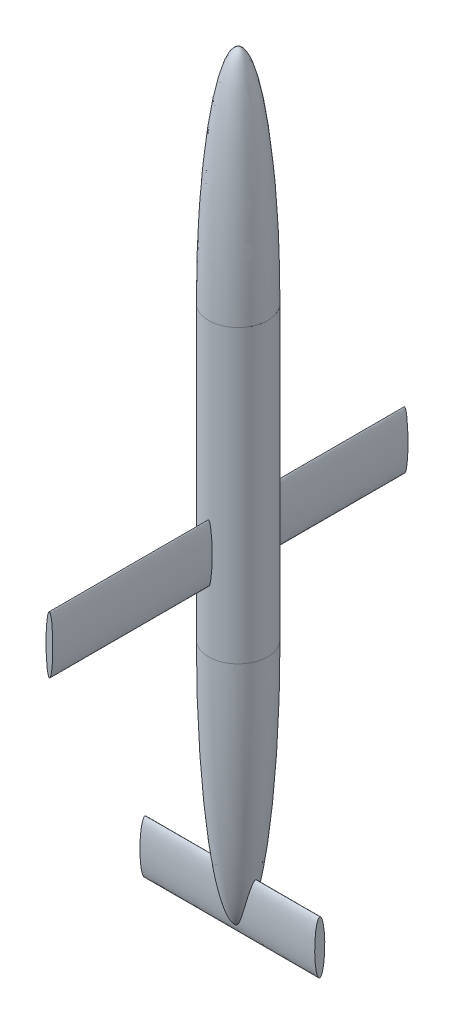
ISO-10303-21;
HEADER;
FILE_DESCRIPTION(('STEP AP214'),'2;1');
FILE_NAME('part.step','',(''),(''),'','','');
FILE_SCHEMA(('AUTOMOTIVE_DESIGN { 1 0 10303 214 1 1 1 1 }'));
ENDSEC;
DATA;
#1=APPLICATION_CONTEXT('core data for automotive mechanical design processes');
#2=APPLICATION_PROTOCOL_DEFINITION('international standard','automotive_design',2000,#1);
#3=PRODUCT_CONTEXT('',#1,'mechanical');
#4=PRODUCT('Part','Part','',(#3));
#5=PRODUCT_RELATED_PRODUCT_CATEGORY('part','',(#4));
#6=PRODUCT_DEFINITION_FORMATION('','',#4);
#7=PRODUCT_DEFINITION_CONTEXT('part definition',#1,'design');
#8=PRODUCT_DEFINITION('design','',#6,#7);
#9=PRODUCT_DEFINITION_SHAPE('','',#8);
#10=(LENGTH_UNIT() NAMED_UNIT(*) SI_UNIT(.MILLI.,.METRE.));
#11=(NAMED_UNIT(*) PLANE_ANGLE_UNIT() SI_UNIT($,.RADIAN.));
#12=(NAMED_UNIT(*) SI_UNIT($,.STERADIAN.) SOLID_ANGLE_UNIT());
#13=UNCERTAINTY_MEASURE_WITH_UNIT(LENGTH_MEASURE(1.E-05),#10,'distance_accuracy_value','');
#14=(GEOMETRIC_REPRESENTATION_CONTEXT(3) GLOBAL_UNCERTAINTY_ASSIGNED_CONTEXT((#13)) GLOBAL_UNIT_ASSIGNED_CONTEXT((#10,
#11,#12)) REPRESENTATION_CONTEXT('',''));
#15=CARTESIAN_POINT('',(0.,0.,0.));
#16=DIRECTION('',(0.,0.,1.));
#17=DIRECTION('',(1.,0.,0.));
#18=AXIS2_PLACEMENT_3D('',#15,#16,#17);
#19=CARTESIAN_POINT('',(0.,-1000.,0.));
#20=DIRECTION('',(0.,1.,0.));
#21=DIRECTION('',(0.,0.,1.));
#22=AXIS2_PLACEMENT_3D('',#19,#20,#21);
#23=CYLINDRICAL_SURFACE('',#22,101.6);
#24=CARTESIAN_POINT('',(0.,-789.588975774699,101.6));
#25=CARTESIAN_POINT('',(0.0437007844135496,-789.588974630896,101.599999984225));
#26=CARTESIAN_POINT('',(0.0874091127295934,-789.586906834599,101.599971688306));
#27=CARTESIAN_POINT('',(0.174451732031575,-789.57871368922,101.599859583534));
#28=CARTESIAN_POINT('',(0.217785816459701,-789.572586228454,101.599775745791));
#29=CARTESIAN_POINT('',(0.346847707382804,-789.548356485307,101.599444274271));
#30=CARTESIAN_POINT('',(0.431518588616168,-789.524407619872,101.599116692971));
#31=CARTESIAN_POINT('',(0.6202563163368,-789.45462850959,101.598162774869));
#32=CARTESIAN_POINT('',(0.72265701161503,-789.404422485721,101.597476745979));
#33=CARTESIAN_POINT('',(0.918336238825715,-789.288694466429,101.595897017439));
#34=CARTESIAN_POINT('',(1.01159485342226,-789.223140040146,101.595002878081));
#35=CARTESIAN_POINT('',(1.1823584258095,-789.087344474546,101.593152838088));
#36=CARTESIAN_POINT('',(1.26052783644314,-789.017920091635,101.59220790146));
#37=CARTESIAN_POINT('',(1.41073386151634,-788.872668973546,101.590233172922));
#38=CARTESIAN_POINT('',(1.48276469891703,-788.796836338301,101.589203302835));
#39=CARTESIAN_POINT('',(1.62171787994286,-788.640315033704,101.587080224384));
#40=CARTESIAN_POINT('',(1.68862619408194,-788.55961403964,101.585986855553));
#41=CARTESIAN_POINT('',(1.81789165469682,-788.394729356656,101.583755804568));
#42=CARTESIAN_POINT('',(1.88025075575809,-788.310547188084,101.58261814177));
#43=CARTESIAN_POINT('',(2.00950595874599,-788.1275819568,101.580148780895));
#44=CARTESIAN_POINT('',(2.07582831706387,-788.028395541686,101.578812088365));
#45=CARTESIAN_POINT('',(2.20425149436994,-787.827313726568,101.576106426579));
#46=CARTESIAN_POINT('',(2.26635136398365,-787.725417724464,101.574737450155));
#47=CARTESIAN_POINT('',(2.38703560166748,-787.519328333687,101.571973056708));
#48=CARTESIAN_POINT('',(2.44561347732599,-787.415131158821,101.570577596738));
#49=CARTESIAN_POINT('',(2.55962424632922,-787.205025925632,101.567768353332));
#50=CARTESIAN_POINT('',(2.61505684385,-787.09911770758,101.566354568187));
#51=CARTESIAN_POINT('',(2.77734177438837,-786.779127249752,101.562090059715));
#52=CARTESIAN_POINT('',(2.88007983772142,-786.562956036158,101.559218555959));
#53=CARTESIAN_POINT('',(3.0774164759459,-786.125731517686,101.553430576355));
#54=CARTESIAN_POINT('',(3.17197358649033,-785.904659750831,101.550513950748));
#55=CARTESIAN_POINT('',(3.35392546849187,-785.459940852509,101.544667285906));
#56=CARTESIAN_POINT('',(3.44132950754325,-785.236297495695,101.541737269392));
#57=CARTESIAN_POINT('',(3.61027311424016,-784.786920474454,101.53587080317));
#58=CARTESIAN_POINT('',(3.69181499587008,-784.561187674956,101.532934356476));
#59=CARTESIAN_POINT('',(3.86450946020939,-784.066344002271,101.526520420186));
#60=CARTESIAN_POINT('',(3.95467247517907,-783.796888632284,101.523042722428));
#61=CARTESIAN_POINT('',(4.1292120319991,-783.256103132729,101.516093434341));
#62=CARTESIAN_POINT('',(4.21358824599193,-782.984772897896,101.512621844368));
#63=CARTESIAN_POINT('',(4.37745508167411,-782.440414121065,101.505687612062));
#64=CARTESIAN_POINT('',(4.45694183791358,-782.167384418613,101.502224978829));
#65=CARTESIAN_POINT('',(4.61161141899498,-781.620105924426,101.495315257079));
#66=CARTESIAN_POINT('',(4.68679413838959,-781.345857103,101.491868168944));
#67=CARTESIAN_POINT('',(4.9067369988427,-780.521441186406,101.481552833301));
#68=CARTESIAN_POINT('',(5.04584489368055,-779.969763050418,101.474712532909));
#69=CARTESIAN_POINT('',(5.31164905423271,-778.86531741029,101.461145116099));
#70=CARTESIAN_POINT('',(5.4383835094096,-778.312558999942,101.45441770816));
#71=CARTESIAN_POINT('',(5.68197764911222,-777.205118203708,101.441066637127));
#72=CARTESIAN_POINT('',(5.79884142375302,-776.650436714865,101.434442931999));
#73=CARTESIAN_POINT('',(6.02426663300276,-775.539453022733,101.421304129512));
#74=CARTESIAN_POINT('',(6.13282887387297,-774.983150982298,101.414789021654));
#75=CARTESIAN_POINT('',(6.39485421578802,-773.593254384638,101.398671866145));
#76=CARTESIAN_POINT('',(6.5439150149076,-772.758829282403,101.389139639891));
#77=CARTESIAN_POINT('',(6.82896364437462,-771.08768390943,101.37033884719));
#78=CARTESIAN_POINT('',(6.96495024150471,-770.250963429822,101.361070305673));
#79=CARTESIAN_POINT('',(7.22590260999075,-768.575439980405,101.342801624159));
#80=CARTESIAN_POINT('',(7.350863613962,-767.736636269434,101.33380160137));
#81=CARTESIAN_POINT('',(7.59120711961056,-766.057684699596,101.316080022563));
#82=CARTESIAN_POINT('',(7.7065898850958,-765.217536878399,101.307358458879));
#83=CARTESIAN_POINT('',(7.96598631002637,-763.256108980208,101.287339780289));
#84=CARTESIAN_POINT('',(8.10673568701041,-762.134396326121,101.276152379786));
#85=CARTESIAN_POINT('',(8.37541693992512,-759.889400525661,101.254286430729));
#86=CARTESIAN_POINT('',(8.50334835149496,-758.766117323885,101.243607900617));
#87=CARTESIAN_POINT('',(8.74796257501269,-756.518310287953,101.222765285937));
#88=CARTESIAN_POINT('',(8.86464523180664,-755.393786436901,101.212601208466));
#89=CARTESIAN_POINT('',(9.08797749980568,-753.143808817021,101.192792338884));
#90=CARTESIAN_POINT('',(9.19462770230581,-752.018355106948,101.183147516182));
#91=CARTESIAN_POINT('',(9.398869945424,-749.766644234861,101.164379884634));
#92=CARTESIAN_POINT('',(9.49646214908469,-748.640387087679,101.155257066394));
#93=CARTESIAN_POINT('',(9.68336905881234,-746.387188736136,101.137535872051));
#94=CARTESIAN_POINT('',(9.7726837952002,-745.260247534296,101.128937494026));
#95=CARTESIAN_POINT('',(9.98638677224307,-742.442763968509,101.108104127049));
#96=CARTESIAN_POINT('',(10.1060119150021,-740.751856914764,101.096197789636));
#97=CARTESIAN_POINT('',(10.3298167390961,-737.369014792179,101.073574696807));
#98=CARTESIAN_POINT('',(10.4339963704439,-735.677079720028,101.062857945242));
#99=CARTESIAN_POINT('',(10.6282044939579,-732.29243744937,101.042618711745));
#100=CARTESIAN_POINT('',(10.7182333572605,-730.599730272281,101.033096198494));
#101=CARTESIAN_POINT('',(10.8851544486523,-727.213661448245,101.015248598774));
#102=CARTESIAN_POINT('',(10.9620466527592,-725.520299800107,101.006923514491));
#103=CARTESIAN_POINT('',(11.1034773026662,-722.133180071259,100.991474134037));
#104=CARTESIAN_POINT('',(11.1680166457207,-720.439422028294,100.984349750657));
#105=CARTESIAN_POINT('',(11.2853621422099,-717.051498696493,100.971303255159));
#106=CARTESIAN_POINT('',(11.3381683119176,-715.357333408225,100.965381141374));
#107=CARTESIAN_POINT('',(11.4325214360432,-711.968685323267,100.954740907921));
#108=CARTESIAN_POINT('',(11.4740683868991,-710.274202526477,100.950022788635));
#109=CARTESIAN_POINT('',(11.5462528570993,-706.884994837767,100.941791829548));
#110=CARTESIAN_POINT('',(11.576890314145,-705.19026994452,100.938278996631));
#111=CARTESIAN_POINT('',(11.6528403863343,-700.105946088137,100.929550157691));
#112=CARTESIAN_POINT('',(11.6821935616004,-696.716093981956,100.926143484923));
#113=CARTESIAN_POINT('',(11.6993243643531,-689.936283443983,100.924159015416));
#114=CARTESIAN_POINT('',(11.6871019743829,-686.546325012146,100.925581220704));
#115=CARTESIAN_POINT('',(11.6372601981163,-681.461684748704,100.931334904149));
#116=CARTESIAN_POINT('',(11.6153944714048,-679.766834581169,100.933856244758));
#117=CARTESIAN_POINT('',(11.560967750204,-676.377315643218,100.940105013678));
#118=CARTESIAN_POINT('',(11.528406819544,-674.68264687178,100.94383243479));
#119=CARTESIAN_POINT('',(11.4523254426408,-671.293582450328,100.952492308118));
#120=CARTESIAN_POINT('',(11.4088051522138,-669.599186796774,100.957424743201));
#121=CARTESIAN_POINT('',(11.3104296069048,-666.210724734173,100.96849328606));
#122=CARTESIAN_POINT('',(11.2555743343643,-664.516658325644,100.974629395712));
#123=CARTESIAN_POINT('',(11.1340322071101,-661.12892120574,100.988103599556));
#124=CARTESIAN_POINT('',(11.0673451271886,-659.435250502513,100.995441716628));
#125=CARTESIAN_POINT('',(10.9214978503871,-656.048452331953,101.011317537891));
#126=CARTESIAN_POINT('',(10.8423376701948,-654.355324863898,101.019855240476));
#127=CARTESIAN_POINT('',(10.6707143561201,-650.969626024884,101.038128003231));
#128=CARTESIAN_POINT('',(10.5782502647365,-649.277054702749,101.047863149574));
#129=CARTESIAN_POINT('',(10.378967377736,-645.89276410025,101.068526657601));
#130=CARTESIAN_POINT('',(10.2721486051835,-644.201044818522,101.079455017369));
#131=CARTESIAN_POINT('',(10.0427684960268,-640.818289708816,101.102502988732));
#132=CARTESIAN_POINT('',(9.92020358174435,-639.127254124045,101.114622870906));
#133=CARTESIAN_POINT('',(9.65756305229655,-635.746533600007,101.140045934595));
#134=CARTESIAN_POINT('',(9.51748729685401,-634.056848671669,101.153349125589));
#135=CARTESIAN_POINT('',(9.21748254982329,-630.679516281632,101.181128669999));
#136=CARTESIAN_POINT('',(9.05755686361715,-628.991868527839,101.195604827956));
#137=CARTESIAN_POINT('',(8.80028333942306,-626.462191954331,101.218191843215));
#138=CARTESIAN_POINT('',(8.71162862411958,-625.619271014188,101.225866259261));
#139=CARTESIAN_POINT('',(8.52797378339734,-623.934124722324,101.241504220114));
#140=CARTESIAN_POINT('',(8.43297368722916,-623.091899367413,101.249467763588));
#141=CARTESIAN_POINT('',(8.23599712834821,-621.408369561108,101.265680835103));
#142=CARTESIAN_POINT('',(8.13402151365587,-620.56706501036,101.273930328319));
#143=CARTESIAN_POINT('',(7.92228795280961,-618.885434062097,101.290713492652));
#144=CARTESIAN_POINT('',(7.81252999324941,-618.04510766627,101.299247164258));
#145=CARTESIAN_POINT('',(7.58420458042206,-616.365407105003,101.316597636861));
#146=CARTESIAN_POINT('',(7.4656346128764,-615.526033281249,101.325414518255));
#147=CARTESIAN_POINT('',(7.21844717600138,-613.848770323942,101.343324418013));
#148=CARTESIAN_POINT('',(7.08982982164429,-613.010881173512,101.352417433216));
#149=CARTESIAN_POINT('',(6.86561811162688,-611.615510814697,101.367802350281));
#150=CARTESIAN_POINT('',(6.77327780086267,-611.057505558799,101.374019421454));
#151=CARTESIAN_POINT('',(6.58272748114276,-609.942488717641,101.386571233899));
#152=CARTESIAN_POINT('',(6.48451739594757,-609.385477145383,101.392905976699));
#153=CARTESIAN_POINT('',(6.28142880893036,-608.272631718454,101.405690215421));
#154=CARTESIAN_POINT('',(6.1765498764,-607.716797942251,101.412139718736));
#155=CARTESIAN_POINT('',(5.95916799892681,-606.606892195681,101.425145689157));
#156=CARTESIAN_POINT('',(5.84666869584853,-606.052819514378,101.431702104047));
#157=CARTESIAN_POINT('',(5.61268445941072,-604.946597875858,101.444918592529));
#158=CARTESIAN_POINT('',(5.49119996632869,-604.394448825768,101.451578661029));
#159=CARTESIAN_POINT('',(5.23748369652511,-603.292669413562,101.464993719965));
#160=CARTESIAN_POINT('',(5.10525313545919,-602.743038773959,101.471748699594));
#161=CARTESIAN_POINT('',(4.89094805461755,-601.897462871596,101.48223636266));
#162=CARTESIAN_POINT('',(4.81355584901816,-601.600328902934,101.485940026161));
#163=CARTESIAN_POINT('',(4.65429555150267,-601.007254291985,101.493368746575));
#164=CARTESIAN_POINT('',(4.57242739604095,-600.711313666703,101.497093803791));
#165=CARTESIAN_POINT('',(4.40352208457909,-600.120835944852,101.504562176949));
#166=CARTESIAN_POINT('',(4.31648379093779,-599.826299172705,101.508305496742));
#167=CARTESIAN_POINT('',(4.13638197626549,-599.239081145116,101.51580405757));
#168=CARTESIAN_POINT('',(4.04331873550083,-598.946399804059,101.519559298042));
#169=CARTESIAN_POINT('',(3.8517576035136,-598.368690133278,101.527006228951));
#170=CARTESIAN_POINT('',(3.75338879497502,-598.083619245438,101.530697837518));
#171=CARTESIAN_POINT('',(3.54823545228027,-597.51653722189,101.538074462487));
#172=CARTESIAN_POINT('',(3.44145168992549,-597.234525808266,101.541759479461));
#173=CARTESIAN_POINT('',(3.21722960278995,-596.674326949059,101.549111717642));
#174=CARTESIAN_POINT('',(3.09977901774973,-596.396144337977,101.552778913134));
#175=CARTESIAN_POINT('',(2.91333596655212,-595.983569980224,101.558240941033));
#176=CARTESIAN_POINT('',(2.84948884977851,-595.846851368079,101.56005485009));
#177=CARTESIAN_POINT('',(2.71779661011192,-595.575358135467,101.563664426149));
#178=CARTESIAN_POINT('',(2.64995185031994,-595.440583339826,101.565460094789));
#179=CARTESIAN_POINT('',(2.50921288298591,-595.172830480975,101.56903480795));
#180=CARTESIAN_POINT('',(2.4362953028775,-595.039864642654,101.570813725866));
#181=CARTESIAN_POINT('',(2.28475514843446,-594.777149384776,101.574335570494));
#182=CARTESIAN_POINT('',(2.20613105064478,-594.647400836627,101.576078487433));
#183=CARTESIAN_POINT('',(2.04225730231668,-594.392793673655,101.579505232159));
#184=CARTESIAN_POINT('',(1.95703269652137,-594.267919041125,101.581189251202));
#185=CARTESIAN_POINT('',(1.77808313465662,-594.024391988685,101.584479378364));
#186=CARTESIAN_POINT('',(1.68436336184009,-593.905735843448,101.586085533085));
#187=CARTESIAN_POINT('',(1.54485669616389,-593.745194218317,101.588262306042));
#188=CARTESIAN_POINT('',(1.50352198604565,-593.699428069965,101.588883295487));
#189=CARTESIAN_POINT('',(1.41890389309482,-593.609786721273,101.590100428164));
#190=CARTESIAN_POINT('',(1.37562196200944,-593.565910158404,101.590696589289));
#191=CARTESIAN_POINT('',(1.28683624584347,-593.480336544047,101.591860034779));
#192=CARTESIAN_POINT('',(1.2413296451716,-593.438642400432,101.592427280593));
#193=CARTESIAN_POINT('',(1.1478303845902,-593.357876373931,101.593526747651));
#194=CARTESIAN_POINT('',(1.0998317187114,-593.318811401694,101.594058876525));
#195=CARTESIAN_POINT('',(1.00058151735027,-593.243508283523,101.595085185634));
#196=CARTESIAN_POINT('',(0.949293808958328,-593.207317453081,101.595578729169));
#197=CARTESIAN_POINT('',(0.843931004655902,-593.139166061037,101.596508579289));
#198=CARTESIAN_POINT('',(0.789855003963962,-593.107206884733,101.596944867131));
#199=CARTESIAN_POINT('',(0.679159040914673,-593.048617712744,101.597745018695));
#200=CARTESIAN_POINT('',(0.622550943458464,-593.021965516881,101.598109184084));
#201=CARTESIAN_POINT('',(0.506797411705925,-592.974902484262,101.598752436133));
#202=CARTESIAN_POINT('',(0.447653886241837,-592.954487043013,101.599031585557));
#203=CARTESIAN_POINT('',(0.348684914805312,-592.926883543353,101.599409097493));
#204=CARTESIAN_POINT('',(0.309445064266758,-592.917572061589,101.599536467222));
#205=CARTESIAN_POINT('',(0.23033566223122,-592.902211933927,101.599746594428));
#206=CARTESIAN_POINT('',(0.190466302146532,-592.89616231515,101.599829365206));
#207=CARTESIAN_POINT('',(0.110372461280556,-592.887496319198,101.599947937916));
#208=CARTESIAN_POINT('',(0.0701481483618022,-592.884878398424,101.599983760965));
#209=CARTESIAN_POINT('',(-0.0103770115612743,-592.883147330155,101.600007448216));
#210=CARTESIAN_POINT('',(-0.0506778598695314,-592.884034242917,101.599995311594));
#211=CARTESIAN_POINT('',(-0.131007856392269,-592.88928503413,101.599923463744));
#212=CARTESIAN_POINT('',(-0.171037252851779,-592.893645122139,101.59986380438));
#213=CARTESIAN_POINT('',(-0.250594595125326,-592.905708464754,101.59969876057));
#214=CARTESIAN_POINT('',(-0.290122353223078,-592.913412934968,101.599593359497));
#215=CARTESIAN_POINT('',(-0.407615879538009,-592.941261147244,101.599212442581));
#216=CARTESIAN_POINT('',(-0.484485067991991,-592.96613919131,101.59887221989));
#217=CARTESIAN_POINT('',(-0.668051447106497,-593.040041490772,101.597862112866));
#218=CARTESIAN_POINT('',(-0.772351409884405,-593.094903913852,101.597112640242));
#219=CARTESIAN_POINT('',(-0.971290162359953,-593.21995360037,101.595406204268));
#220=CARTESIAN_POINT('',(-1.06590258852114,-593.290181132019,101.594448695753));
#221=CARTESIAN_POINT('',(-1.24164815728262,-593.437057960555,101.592448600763));
#222=CARTESIAN_POINT('',(-1.32322551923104,-593.513186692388,101.59141298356));
#223=CARTESIAN_POINT('',(-1.47971092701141,-593.672075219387,101.589254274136));
#224=CARTESIAN_POINT('',(-1.55461232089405,-593.754841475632,101.588131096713));
#225=CARTESIAN_POINT('',(-1.69893837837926,-593.925372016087,101.585820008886));
#226=CARTESIAN_POINT('',(-1.76834697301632,-594.01314975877,101.584631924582));
#227=CARTESIAN_POINT('',(-1.90231570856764,-594.192230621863,101.582211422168));
#228=CARTESIAN_POINT('',(-1.96687836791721,-594.283531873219,101.580979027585));
#229=CARTESIAN_POINT('',(-2.09694896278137,-594.476325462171,101.578380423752));
#230=CARTESIAN_POINT('',(-2.16211545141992,-594.578046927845,101.577011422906));
#231=CARTESIAN_POINT('',(-2.28841769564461,-594.78397315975,101.574244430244));
#232=CARTESIAN_POINT('',(-2.34955270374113,-594.888178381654,101.572846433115));
#233=CARTESIAN_POINT('',(-2.46845653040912,-595.098723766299,101.570026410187));
#234=CARTESIAN_POINT('',(-2.52621930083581,-595.205067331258,101.56860434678));
#235=CARTESIAN_POINT('',(-2.63872339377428,-595.419344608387,101.565743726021));
#236=CARTESIAN_POINT('',(-2.69346446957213,-595.52727844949,101.564305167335));
#237=CARTESIAN_POINT('',(-2.85396008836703,-595.85349333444,101.559964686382));
#238=CARTESIAN_POINT('',(-2.95573593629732,-596.073734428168,101.557044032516));
#239=CARTESIAN_POINT('',(-3.15096419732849,-596.517935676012,101.551173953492));
#240=CARTESIAN_POINT('',(-3.24441319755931,-596.741897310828,101.548224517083));
#241=CARTESIAN_POINT('',(-3.42514762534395,-597.194158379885,101.542289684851));
#242=CARTESIAN_POINT('',(-3.51238369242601,-597.422477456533,101.539304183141));
#243=CARTESIAN_POINT('',(-3.68095403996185,-597.880812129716,101.533332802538));
#244=CARTESIAN_POINT('',(-3.76229853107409,-598.110823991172,101.530346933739));
#245=CARTESIAN_POINT('',(-3.92005210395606,-598.572299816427,101.52437842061));
#246=CARTESIAN_POINT('',(-3.99646551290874,-598.803762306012,101.521395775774));
#247=CARTESIAN_POINT('',(-4.14508453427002,-599.267971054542,101.515436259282));
#248=CARTESIAN_POINT('',(-4.21729110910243,-599.500717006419,101.512459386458));
#249=CARTESIAN_POINT('',(-4.37968815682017,-600.039052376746,101.5055999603));
#250=CARTESIAN_POINT('',(-4.4685808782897,-600.345032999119,101.501720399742));
#251=CARTESIAN_POINT('',(-4.64103690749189,-600.958497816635,101.493981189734));
#252=CARTESIAN_POINT('',(-4.72460002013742,-601.265982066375,101.490121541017));
#253=CARTESIAN_POINT('',(-4.88716932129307,-601.882419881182,101.482423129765));
#254=CARTESIAN_POINT('',(-4.96617172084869,-602.191374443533,101.478584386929));
#255=CARTESIAN_POINT('',(-5.12010635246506,-602.810298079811,101.470933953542));
#256=CARTESIAN_POINT('',(-5.19503851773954,-603.120267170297,101.467122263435));
#257=CARTESIAN_POINT('',(-5.41447297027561,-604.05161525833,101.455729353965));
#258=CARTESIAN_POINT('',(-5.55357050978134,-604.674270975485,101.448192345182));
#259=CARTESIAN_POINT('',(-5.81941433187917,-605.918838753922,101.433288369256));
#260=CARTESIAN_POINT('',(-5.94622052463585,-606.540738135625,101.425920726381));
#261=CARTESIAN_POINT('',(-6.19013434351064,-607.786204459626,101.41132656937));
#262=CARTESIAN_POINT('',(-6.307245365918,-608.4097707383,101.404100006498));
#263=CARTESIAN_POINT('',(-6.53321325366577,-609.658337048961,101.389791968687));
#264=CARTESIAN_POINT('',(-6.64207081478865,-610.283336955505,101.382710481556));
#265=CARTESIAN_POINT('',(-6.90510644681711,-611.846346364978,101.365203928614));
#266=CARTESIAN_POINT('',(-7.05483137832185,-612.785106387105,101.354871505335));
#267=CARTESIAN_POINT('',(-7.34093821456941,-614.6647233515,101.334550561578));
#268=CARTESIAN_POINT('',(-7.47731903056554,-615.605580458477,101.324562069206));
#269=CARTESIAN_POINT('',(-7.7388250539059,-617.490038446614,101.304924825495));
#270=CARTESIAN_POINT('',(-7.86393617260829,-618.433641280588,101.295276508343));
#271=CARTESIAN_POINT('',(-8.10418744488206,-620.322091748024,101.276338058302));
#272=CARTESIAN_POINT('',(-8.2193278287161,-621.266939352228,101.267047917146));
#273=CARTESIAN_POINT('',(-8.44074212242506,-623.15729630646,101.248833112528));
#274=CARTESIAN_POINT('',(-8.54701950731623,-624.102805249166,101.23990830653));
#275=CARTESIAN_POINT('',(-8.75165880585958,-625.994683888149,101.2224233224));
#276=CARTESIAN_POINT('',(-8.85002067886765,-626.941053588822,101.21386314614));
#277=CARTESIAN_POINT('',(-9.13437133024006,-629.781293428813,101.188732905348));
#278=CARTESIAN_POINT('',(-9.30961988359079,-631.676248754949,101.172713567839));
#279=CARTESIAN_POINT('',(-9.63583587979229,-635.467536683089,101.142164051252));
#280=CARTESIAN_POINT('',(-9.78681216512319,-637.363868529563,101.127633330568));
#281=CARTESIAN_POINT('',(-10.0676160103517,-641.158114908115,101.100064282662));
#282=CARTESIAN_POINT('',(-10.1974434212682,-643.056029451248,101.087025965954));
#283=CARTESIAN_POINT('',(-10.4381714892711,-646.852675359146,101.062451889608));
#284=CARTESIAN_POINT('',(-10.5490759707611,-648.751406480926,101.050915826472));
#285=CARTESIAN_POINT('',(-10.7536617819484,-652.549806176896,101.029348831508));
#286=CARTESIAN_POINT('',(-10.847343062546,-654.449474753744,101.019317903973));
#287=CARTESIAN_POINT('',(-11.0187515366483,-658.249660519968,101.000765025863));
#288=CARTESIAN_POINT('',(-11.0964776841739,-660.150177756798,100.992243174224));
#289=CARTESIAN_POINT('',(-11.2369249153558,-663.951768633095,100.976712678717));
#290=CARTESIAN_POINT('',(-11.2996460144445,-665.852842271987,100.969704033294));
#291=CARTESIAN_POINT('',(-11.4107957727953,-669.655238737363,100.957203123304));
#292=CARTESIAN_POINT('',(-11.4592257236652,-671.556561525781,100.951710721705));
#293=CARTESIAN_POINT('',(-11.5423239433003,-675.359510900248,100.942243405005));
#294=CARTESIAN_POINT('',(-11.576992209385,-677.261137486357,100.938268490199));
#295=CARTESIAN_POINT('',(-11.6329253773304,-681.064543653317,100.931837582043));
#296=CARTESIAN_POINT('',(-11.6541906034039,-682.966323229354,100.929381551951));
#297=CARTESIAN_POINT('',(-11.6835331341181,-686.76999013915,100.925989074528));
#298=CARTESIAN_POINT('',(-11.691610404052,-688.67187747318,100.925052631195));
#299=CARTESIAN_POINT('',(-11.6946570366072,-692.475655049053,100.924699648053));
#300=CARTESIAN_POINT('',(-11.6896264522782,-694.377545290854,100.925283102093));
#301=CARTESIAN_POINT('',(-11.6664076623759,-698.181244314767,100.927969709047));
#302=CARTESIAN_POINT('',(-11.6482194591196,-700.083053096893,100.930072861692));
#303=CARTESIAN_POINT('',(-11.5985027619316,-703.886526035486,100.935798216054));
#304=CARTESIAN_POINT('',(-11.5669740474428,-705.788190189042,100.939420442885));
#305=CARTESIAN_POINT('',(-11.4902524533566,-709.591234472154,100.94818270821));
#306=CARTESIAN_POINT('',(-11.4450596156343,-711.492614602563,100.953322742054));
#307=CARTESIAN_POINT('',(-11.340524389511,-715.29507645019,100.965119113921));
#308=CARTESIAN_POINT('',(-11.2811813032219,-717.196158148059,100.971775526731));
#309=CARTESIAN_POINT('',(-11.1476777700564,-720.997798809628,100.986602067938));
#310=CARTESIAN_POINT('',(-11.0735173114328,-722.898357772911,100.994772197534));
#311=CARTESIAN_POINT('',(-10.9094850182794,-726.698747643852,101.012622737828));
#312=CARTESIAN_POINT('',(-10.8196135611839,-728.598578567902,101.022303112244));
#313=CARTESIAN_POINT('',(-10.6229733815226,-732.397357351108,101.043170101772));
#314=CARTESIAN_POINT('',(-10.5162046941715,-734.296305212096,101.054356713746));
#315=CARTESIAN_POINT('',(-10.2842152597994,-738.092905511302,101.078229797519));
#316=CARTESIAN_POINT('',(-10.1589961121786,-739.990558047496,101.090916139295));
#317=CARTESIAN_POINT('',(-9.88800553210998,-743.784378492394,101.117782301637));
#318=CARTESIAN_POINT('',(-9.74223423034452,-745.68054641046,101.131962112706));
#319=CARTESIAN_POINT('',(-9.42729808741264,-749.471081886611,101.161807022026));
#320=CARTESIAN_POINT('',(-9.25813163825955,-751.365449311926,101.177472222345));
#321=CARTESIAN_POINT('',(-8.98380622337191,-754.20497823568,101.202072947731));
#322=CARTESIAN_POINT('',(-8.88893595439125,-755.151143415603,101.210456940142));
#323=CARTESIAN_POINT('',(-8.69165026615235,-757.042682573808,101.227590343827));
#324=CARTESIAN_POINT('',(-8.58923488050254,-757.988056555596,101.236339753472));
#325=CARTESIAN_POINT('',(-8.37602548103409,-759.878052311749,101.254203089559));
#326=CARTESIAN_POINT('',(-8.26522977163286,-760.822673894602,101.263317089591));
#327=CARTESIAN_POINT('',(-8.03425534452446,-762.710773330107,101.281904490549));
#328=CARTESIAN_POINT('',(-7.91407659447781,-763.654251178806,101.291377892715));
#329=CARTESIAN_POINT('',(-7.66303558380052,-765.539765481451,101.310679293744));
#330=CARTESIAN_POINT('',(-7.53217354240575,-766.481801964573,101.32050728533));
#331=CARTESIAN_POINT('',(-7.25807082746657,-768.364066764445,101.340511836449));
#332=CARTESIAN_POINT('',(-7.11483035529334,-769.304295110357,101.35068839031));
#333=CARTESIAN_POINT('',(-6.87483041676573,-770.800864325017,101.367177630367));
#334=CARTESIAN_POINT('',(-6.78283091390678,-771.357970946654,101.373380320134));
#335=CARTESIAN_POINT('',(-6.59300736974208,-772.471188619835,101.385902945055));
#336=CARTESIAN_POINT('',(-6.49518337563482,-773.027299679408,101.392222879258));
#337=CARTESIAN_POINT('',(-6.29293221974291,-774.138296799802,101.404976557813));
#338=CARTESIAN_POINT('',(-6.18850533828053,-774.693182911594,101.411410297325));
#339=CARTESIAN_POINT('',(-5.9720501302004,-775.801468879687,101.42438755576));
#340=CARTESIAN_POINT('',(-5.8600219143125,-776.354868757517,101.430931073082));
#341=CARTESIAN_POINT('',(-5.66443847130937,-777.282469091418,101.442005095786));
#342=CARTESIAN_POINT('',(-5.58328522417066,-777.657176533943,101.446507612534));
#343=CARTESIAN_POINT('',(-5.41633984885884,-778.405555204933,101.455558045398));
#344=CARTESIAN_POINT('',(-5.33054776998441,-778.779226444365,101.460105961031));
#345=CARTESIAN_POINT('',(-5.15366846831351,-779.5253426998,101.46924433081));
#346=CARTESIAN_POINT('',(-5.06258088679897,-779.897787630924,101.47383478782));
#347=CARTESIAN_POINT('',(-4.87429254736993,-780.641128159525,101.483053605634));
#348=CARTESIAN_POINT('',(-4.77709192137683,-781.012023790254,101.487681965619));
#349=CARTESIAN_POINT('',(-4.60747395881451,-781.634484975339,101.495497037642));
#350=CARTESIAN_POINT('',(-4.53697835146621,-781.886574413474,101.498675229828));
#351=CARTESIAN_POINT('',(-4.39218837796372,-782.38965894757,101.505043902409));
#352=CARTESIAN_POINT('',(-4.31789407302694,-782.640654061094,101.508234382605));
#353=CARTESIAN_POINT('',(-4.164981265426,-783.141255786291,101.514623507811));
#354=CARTESIAN_POINT('',(-4.08636388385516,-783.390862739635,101.5178221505));
#355=CARTESIAN_POINT('',(-3.92410026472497,-783.888436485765,101.524223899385));
#356=CARTESIAN_POINT('',(-3.84045418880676,-784.136403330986,101.527427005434));
#357=CARTESIAN_POINT('',(-3.69424588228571,-784.553236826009,101.532832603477));
#358=CARTESIAN_POINT('',(-3.63324523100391,-784.722651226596,101.535035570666));
#359=CARTESIAN_POINT('',(-3.50806005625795,-785.06029804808,101.539437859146));
#360=CARTESIAN_POINT('',(-3.44387562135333,-785.228530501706,101.541637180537));
#361=CARTESIAN_POINT('',(-3.31181789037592,-785.563675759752,101.546030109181));
#362=CARTESIAN_POINT('',(-3.24394215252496,-785.730587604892,101.548223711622));
#363=CARTESIAN_POINT('',(-3.10396257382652,-786.062628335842,101.552598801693));
#364=CARTESIAN_POINT('',(-3.03185891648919,-786.227757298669,101.554780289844));
#365=CARTESIAN_POINT('',(-2.88748861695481,-786.54517110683,101.558984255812));
#366=CARTESIAN_POINT('',(-2.81553302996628,-786.697596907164,101.561007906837));
#367=CARTESIAN_POINT('',(-2.66647229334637,-786.999908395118,101.565030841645));
#368=CARTESIAN_POINT('',(-2.58936761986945,-787.149794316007,101.567030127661));
#369=CARTESIAN_POINT('',(-2.42899525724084,-787.446142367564,101.57099200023));
#370=CARTESIAN_POINT('',(-2.34573101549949,-787.592606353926,101.572954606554));
#371=CARTESIAN_POINT('',(-2.17160838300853,-787.880938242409,101.576826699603));
#372=CARTESIAN_POINT('',(-2.0807531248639,-788.022808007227,101.57873620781));
#373=CARTESIAN_POINT('',(-1.93426981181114,-788.235030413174,101.581598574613));
#374=CARTESIAN_POINT('',(-1.88207601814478,-788.307754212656,101.582580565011));
#375=CARTESIAN_POINT('',(-1.77459280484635,-788.450869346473,101.584515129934));
#376=CARTESIAN_POINT('',(-1.71930396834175,-788.521261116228,101.585467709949));
#377=CARTESIAN_POINT('',(-1.60516650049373,-788.659128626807,101.587335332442));
#378=CARTESIAN_POINT('',(-1.54631760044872,-788.726604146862,101.588250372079));
#379=CARTESIAN_POINT('',(-1.42455718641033,-788.857759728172,101.590030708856));
#380=CARTESIAN_POINT('',(-1.36164699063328,-788.921441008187,101.590896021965));
#381=CARTESIAN_POINT('',(-1.20590514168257,-789.067586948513,101.592883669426));
#382=CARTESIAN_POINT('',(-1.11090782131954,-789.14779640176,101.593976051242));
#383=CARTESIAN_POINT('',(-0.910470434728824,-789.29402763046,101.595969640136));
#384=CARTESIAN_POINT('',(-0.805050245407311,-789.360075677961,101.596871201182));
#385=CARTESIAN_POINT('',(-0.615778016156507,-789.45471858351,101.59816400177));
#386=CARTESIAN_POINT('',(-0.534643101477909,-789.488617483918,101.598627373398));
#387=CARTESIAN_POINT('',(-0.40973844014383,-789.529203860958,101.599182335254));
#388=CARTESIAN_POINT('',(-0.367610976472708,-789.541016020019,101.599343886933));
#389=CARTESIAN_POINT('',(-0.282494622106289,-789.56092106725,101.599616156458));
#390=CARTESIAN_POINT('',(-0.239506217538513,-789.56901599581,101.599726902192));
#391=CARTESIAN_POINT('',(-0.16375100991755,-789.579711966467,101.599873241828));
#392=CARTESIAN_POINT('',(-0.131104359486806,-789.583179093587,101.599920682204));
#393=CARTESIAN_POINT('',(-0.0656399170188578,-789.587811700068,101.599984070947));
#394=CARTESIAN_POINT('',(-0.0328220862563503,-789.588976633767,101.600000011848));
#395=CARTESIAN_POINT('',(0.,-789.588975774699,101.6));
#396=B_SPLINE_CURVE_WITH_KNOTS('',3,(#24,#25,#26,#27,#28,#29,#30,#31,#32,#33,#34,#35,#36,#37,
#38,#39,#40,#41,#42,#43,#44,#45,#46,#47,#48,#49,#50,#51,#52,#53,#54,#55,#56,#57,#58,#59,#60,#61,
#62,#63,#64,#65,#66,#67,#68,#69,#70,#71,#72,#73,#74,#75,#76,#77,#78,#79,#80,#81,#82,#83,#84,#85,
#86,#87,#88,#89,#90,#91,#92,#93,#94,#95,#96,#97,#98,#99,#100,#101,#102,#103,#104,#105,#106,#107,
#108,#109,#110,#111,#112,#113,#114,#115,#116,#117,#118,#119,#120,#121,#122,#123,#124,#125,#126,
#127,#128,#129,#130,#131,#132,#133,#134,#135,#136,#137,#138,#139,#140,#141,#142,#143,#144,#145,
#146,#147,#148,#149,#150,#151,#152,#153,#154,#155,#156,#157,#158,#159,#160,#161,#162,#163,#164,
#165,#166,#167,#168,#169,#170,#171,#172,#173,#174,#175,#176,#177,#178,#179,#180,#181,#182,#183,
#184,#185,#186,#187,#188,#189,#190,#191,#192,#193,#194,#195,#196,#197,#198,#199,#200,#201,#202,
#203,#204,#205,#206,#207,#208,#209,#210,#211,#212,#213,#214,#215,#216,#217,#218,#219,#220,#221,
#222,#223,#224,#225,#226,#227,#228,#229,#230,#231,#232,#233,#234,#235,#236,#237,#238,#239,#240,
#241,#242,#243,#244,#245,#246,#247,#248,#249,#250,#251,#252,#253,#254,#255,#256,#257,#258,#259,
#260,#261,#262,#263,#264,#265,#266,#267,#268,#269,#270,#271,#272,#273,#274,#275,#276,#277,#278,
#279,#280,#281,#282,#283,#284,#285,#286,#287,#288,#289,#290,#291,#292,#293,#294,#295,#296,#297,
#298,#299,#300,#301,#302,#303,#304,#305,#306,#307,#308,#309,#310,#311,#312,#313,#314,#315,#316,
#317,#318,#319,#320,#321,#322,#323,#324,#325,#326,#327,#328,#329,#330,#331,#332,#333,#334,#335,
#336,#337,#338,#339,#340,#341,#342,#343,#344,#345,#346,#347,#348,#349,#350,#351,#352,#353,#354,
#355,#356,#357,#358,#359,#360,#361,#362,#363,#364,#365,#366,#367,#368,#369,#370,#371,#372,#373,
#374,#375,#376,#377,#378,#379,#380,#381,#382,#383,#384,#385,#386,#387,#388,#389,#390,#391,#392,
#393,#394,#395),.UNSPECIFIED.,.T.,.F.,(4,2,2,2,2,2,2,2,2,2,2,2,2,2,2,2,2,2,2,2,2,2,2,2,2,2,2,2,
2,2,2,2,2,2,2,2,2,2,2,2,2,2,2,2,2,2,2,2,2,2,2,2,2,2,2,2,2,2,2,2,2,2,2,2,2,2,2,2,2,2,2,2,2,2,2,2,
2,2,2,2,2,2,2,2,2,2,2,2,2,2,2,2,2,2,2,2,2,2,2,2,2,2,2,2,2,2,2,2,2,2,2,2,2,2,2,2,2,2,2,2,2,2,2,2,
2,2,2,2,2,2,2,2,2,2,2,2,2,2,2,2,2,2,2,2,2,2,2,2,2,2,2,2,2,2,2,2,2,2,2,2,2,2,2,2,2,2,2,2,2,2,2,2,
2,2,2,2,2,2,2,2,2,2,2,2,2,4),(0.,0.131064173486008,0.26219657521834,0.524805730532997,
0.865051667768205,1.20602313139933,1.51921961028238,1.83270765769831,2.14702565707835,
2.4612078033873,2.81905013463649,3.17697265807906,3.53553592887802,3.89413286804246,
4.61193750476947,5.33318978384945,6.05349229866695,6.77350890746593,7.6259116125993,
8.47836257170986,9.33147901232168,10.184616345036,11.8913865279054,13.5927103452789,
15.2933256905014,16.9937756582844,19.5367022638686,22.0798684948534,24.6241290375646,
27.1683194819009,30.5599200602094,33.9516434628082,37.3434136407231,40.7349837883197,
44.1264928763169,47.517989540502,52.6034300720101,57.6888870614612,62.7742106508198,
67.8595435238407,72.9445068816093,78.0294631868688,83.1144211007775,88.19940805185,
98.369069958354,108.538736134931,113.623687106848,118.708607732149,123.793456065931,
128.878312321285,133.963265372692,139.048211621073,144.133524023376,149.218828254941,
154.305289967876,159.391792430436,164.477449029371,167.020244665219,169.563028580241,
172.105503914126,174.647983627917,177.19119157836,179.734370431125,181.431228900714,
183.128109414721,184.825099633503,186.521284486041,188.217386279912,189.913296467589,
190.834477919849,191.755672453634,192.677070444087,193.59842560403,194.503080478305,
195.407652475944,196.313277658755,196.76593589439,197.218553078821,197.673414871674,
198.128398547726,198.581733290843,199.034793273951,199.219763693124,199.404598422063,
199.589673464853,199.775217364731,199.963362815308,200.151569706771,200.338971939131,
200.526235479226,200.647103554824,200.767935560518,200.888713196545,201.009492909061,
201.130140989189,201.250832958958,201.492237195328,201.843811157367,202.196317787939,
202.530577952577,202.865167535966,203.200702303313,203.536061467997,203.898387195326,
204.26077991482,204.623803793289,204.986857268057,205.714517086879,206.442473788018,
207.175685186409,207.907593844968,208.638851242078,209.369940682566,210.325846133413,
211.281786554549,212.238510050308,213.195249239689,215.109236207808,217.013367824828,
218.916829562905,220.820130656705,223.672048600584,226.524199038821,229.379866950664,
232.23546889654,235.089945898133,237.944437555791,243.653558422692,249.36059469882,
255.067671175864,260.773592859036,266.479530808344,272.185842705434,277.892148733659,
283.597938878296,289.303730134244,295.009383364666,300.715051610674,306.420696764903,
312.126340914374,317.832079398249,323.537800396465,329.243802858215,334.94980984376,
340.655679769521,346.361537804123,352.066901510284,357.772228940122,363.477948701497,
366.330763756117,369.183566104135,372.036947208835,374.890338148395,377.743670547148,
380.596956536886,382.290989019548,383.985007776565,385.67895466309,387.372876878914,
388.523115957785,389.673342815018,390.823647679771,391.973927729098,392.759243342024,
393.544546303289,394.329646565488,395.114721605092,395.654921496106,396.195106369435,
396.735653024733,397.276176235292,397.781802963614,398.287382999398,398.792682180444,
399.297773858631,399.566268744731,399.834713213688,400.10317796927,400.3715560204,
400.743680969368,401.115109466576,401.377835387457,401.508951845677,401.639996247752,
401.738410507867,401.836848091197),.UNSPECIFIED.);
#397=CARTESIAN_POINT('',(0.,-789.588975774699,101.6));
#398=VERTEX_POINT('',#397);
#399=EDGE_CURVE('E59',#398,#398,#396,.T.);
#400=ORIENTED_EDGE('',*,*,#399,.F.);
#401=EDGE_LOOP('',(#400));
#402=FACE_BOUND('',#401,.T.);
#403=CARTESIAN_POINT('',(0.,-592.883691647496,-101.6));
#404=CARTESIAN_POINT('',(0.0437009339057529,-592.883692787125,-101.599999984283));
#405=CARTESIAN_POINT('',(0.0874093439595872,-592.885760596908,-101.599971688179));
#406=CARTESIAN_POINT('',(0.174452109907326,-592.893953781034,-101.599859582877));
#407=CARTESIAN_POINT('',(0.217786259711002,-592.900081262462,-101.599775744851));
#408=CARTESIAN_POINT('',(0.346848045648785,-592.924311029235,-101.599444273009));
#409=CARTESIAN_POINT('',(0.431518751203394,-592.948259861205,-101.599116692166));
#410=CARTESIAN_POINT('',(0.620256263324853,-593.018038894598,-101.598162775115));
#411=CARTESIAN_POINT('',(0.72265691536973,-593.068244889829,-101.597476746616));
#412=CARTESIAN_POINT('',(0.918336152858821,-593.183972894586,-101.595897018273));
#413=CARTESIAN_POINT('',(1.01159481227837,-593.249527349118,-101.595002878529));
#414=CARTESIAN_POINT('',(1.18235840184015,-593.385322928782,-101.593152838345));
#415=CARTESIAN_POINT('',(1.2605277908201,-593.454747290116,-101.592207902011));
#416=CARTESIAN_POINT('',(1.41073377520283,-593.599998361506,-101.590233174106));
#417=CARTESIAN_POINT('',(1.48276459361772,-593.675830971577,-101.58920330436));
#418=CARTESIAN_POINT('',(1.62171778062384,-593.832352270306,-101.587080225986));
#419=CARTESIAN_POINT('',(1.68862611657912,-593.913053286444,-101.585986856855));
#420=CARTESIAN_POINT('',(1.81789161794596,-594.077938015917,-101.583755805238));
#421=CARTESIAN_POINT('',(1.88025073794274,-594.162120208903,-101.582618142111));
#422=CARTESIAN_POINT('',(2.00950611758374,-594.345085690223,-101.58014877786));
#423=CARTESIAN_POINT('',(2.07582862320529,-594.444272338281,-101.578812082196));
#424=CARTESIAN_POINT('',(2.20425207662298,-594.645354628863,-101.576106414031));
#425=CARTESIAN_POINT('',(2.26635207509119,-594.747250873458,-101.574737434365));
#426=CARTESIAN_POINT('',(2.38703655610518,-594.95334075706,-101.571973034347));
#427=CARTESIAN_POINT('',(2.44561454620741,-595.057538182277,-101.57057757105));
#428=CARTESIAN_POINT('',(2.55962553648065,-595.267643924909,-101.567768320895));
#429=CARTESIAN_POINT('',(2.6150582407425,-595.373552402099,-101.56635453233));
#430=CARTESIAN_POINT('',(2.77734346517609,-595.693543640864,-101.562090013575));
#431=CARTESIAN_POINT('',(2.88008168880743,-595.909715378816,-101.55921850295));
#432=CARTESIAN_POINT('',(3.07741826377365,-596.346939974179,-101.553430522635));
#433=CARTESIAN_POINT('',(3.17197519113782,-596.568011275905,-101.550513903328));
#434=CARTESIAN_POINT('',(3.35392638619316,-597.012729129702,-101.544667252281));
#435=CARTESIAN_POINT('',(3.44132992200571,-597.236371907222,-101.541737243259));
#436=CARTESIAN_POINT('',(3.61027387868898,-597.685748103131,-101.535870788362));
#437=CARTESIAN_POINT('',(3.69181661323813,-597.911480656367,-101.532934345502));
#438=CARTESIAN_POINT('',(3.84111497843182,-598.339291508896,-101.527389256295));
#439=CARTESIAN_POINT('',(3.90939207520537,-598.541188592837,-101.524780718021));
#440=CARTESIAN_POINT('',(4.04253960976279,-598.946104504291,-101.519566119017));
#441=CARTESIAN_POINT('',(4.10740997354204,-599.149123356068,-101.516960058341));
#442=CARTESIAN_POINT('',(4.29753573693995,-599.759627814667,-101.509149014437));
#443=CARTESIAN_POINT('',(4.41829073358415,-600.168517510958,-101.503951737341));
#444=CARTESIAN_POINT('',(4.65026120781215,-600.989322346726,-101.493588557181));
#445=CARTESIAN_POINT('',(4.7614689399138,-601.401239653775,-101.488422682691));
#446=CARTESIAN_POINT('',(4.97589490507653,-602.227155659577,-101.47813551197));
#447=CARTESIAN_POINT('',(5.07911288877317,-602.641154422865,-101.473014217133));
#448=CARTESIAN_POINT('',(5.27845728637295,-603.469416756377,-101.462839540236));
#449=CARTESIAN_POINT('',(5.37460579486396,-603.883675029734,-101.457785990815));
#450=CARTESIAN_POINT('',(5.56110773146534,-604.713496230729,-101.447734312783));
#451=CARTESIAN_POINT('',(5.65146108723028,-605.129059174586,-101.442736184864));
#452=CARTESIAN_POINT('',(5.82706208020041,-605.961088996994,-101.432800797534));
#453=CARTESIAN_POINT('',(5.91231172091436,-606.377555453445,-101.427863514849));
#454=CARTESIAN_POINT('',(6.07831887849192,-607.211385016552,-101.418050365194));
#455=CARTESIAN_POINT('',(6.15907634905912,-607.628748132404,-101.413174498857));
#456=CARTESIAN_POINT('',(6.39485909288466,-608.879431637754,-101.398671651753));
#457=CARTESIAN_POINT('',(6.54392279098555,-609.713879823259,-101.389139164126));
#458=CARTESIAN_POINT('',(6.82897766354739,-611.385069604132,-101.370337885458));
#459=CARTESIAN_POINT('',(6.96496759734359,-612.221811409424,-101.361069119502));
#460=CARTESIAN_POINT('',(7.22591640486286,-613.897320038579,-101.342800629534));
#461=CARTESIAN_POINT('',(7.35087127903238,-614.736087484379,-101.333801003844));
#462=CARTESIAN_POINT('',(7.59120946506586,-616.414996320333,-101.316079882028));
#463=CARTESIAN_POINT('',(7.70659270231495,-617.255137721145,-101.30735838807));
#464=CARTESIAN_POINT('',(7.92889225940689,-618.936085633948,-101.290202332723));
#465=CARTESIAN_POINT('',(8.03581304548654,-619.776891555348,-101.281767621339));
#466=CARTESIAN_POINT('',(8.24216661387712,-621.459426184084,-101.265183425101));
#467=CARTESIAN_POINT('',(8.34159934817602,-622.301154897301,-101.257033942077));
#468=CARTESIAN_POINT('',(8.6297802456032,-624.827259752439,-101.233019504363));
#469=CARTESIAN_POINT('',(8.80844244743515,-626.512795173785,-101.217586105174));
#470=CARTESIAN_POINT('',(9.14332531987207,-629.886331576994,-101.187883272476));
#471=CARTESIAN_POINT('',(9.29954262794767,-631.574332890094,-101.173614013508));
#472=CARTESIAN_POINT('',(9.59256870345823,-634.952042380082,-101.14625186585));
#473=CARTESIAN_POINT('',(9.72937723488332,-636.641750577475,-101.133158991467));
#474=CARTESIAN_POINT('',(9.9858554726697,-640.022610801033,-101.108156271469));
#475=CARTESIAN_POINT('',(10.1055237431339,-641.713762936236,-101.096246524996));
#476=CARTESIAN_POINT('',(10.3294047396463,-645.097095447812,-101.073616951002));
#477=CARTESIAN_POINT('',(10.4336174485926,-646.789275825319,-101.062897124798));
#478=CARTESIAN_POINT('',(10.6278682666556,-650.174079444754,-101.042654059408));
#479=CARTESIAN_POINT('',(10.7179094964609,-651.866702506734,-101.033130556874));
#480=CARTESIAN_POINT('',(10.8848555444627,-655.252608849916,-101.015280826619));
#481=CARTESIAN_POINT('',(10.9617602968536,-656.945892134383,-101.006954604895));
#482=CARTESIAN_POINT('',(11.1032219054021,-660.33298991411,-100.991502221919));
#483=CARTESIAN_POINT('',(11.167778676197,-662.026804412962,-100.984376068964));
#484=CARTESIAN_POINT('',(11.2851579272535,-665.414844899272,-100.971326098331));
#485=CARTESIAN_POINT('',(11.3379803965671,-667.109070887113,-100.965402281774));
#486=CARTESIAN_POINT('',(11.432361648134,-670.497759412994,-100.954758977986));
#487=CARTESIAN_POINT('',(11.4739209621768,-672.192221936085,-100.950039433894));
#488=CARTESIAN_POINT('',(11.5461328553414,-675.581362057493,-100.941805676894));
#489=CARTESIAN_POINT('',(11.5767855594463,-677.276039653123,-100.938291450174));
#490=CARTESIAN_POINT('',(11.6274382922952,-680.665576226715,-100.932469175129));
#491=CARTESIAN_POINT('',(11.6474381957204,-682.360435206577,-100.930161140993));
#492=CARTESIAN_POINT('',(11.6769408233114,-685.750248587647,-100.926751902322));
#493=CARTESIAN_POINT('',(11.6864435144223,-687.445202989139,-100.925650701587));
#494=CARTESIAN_POINT('',(11.6993418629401,-692.530064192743,-100.924157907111));
#495=CARTESIAN_POINT('',(11.6871286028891,-695.920023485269,-100.925577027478));
#496=CARTESIAN_POINT('',(11.6207435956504,-702.699528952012,-100.933242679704));
#497=CARTESIAN_POINT('',(11.5665718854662,-706.089075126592,-100.939489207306));
#498=CARTESIAN_POINT('',(11.4524790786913,-711.172675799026,-100.952474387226));
#499=CARTESIAN_POINT('',(11.4089747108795,-712.867114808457,-100.957405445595));
#500=CARTESIAN_POINT('',(11.3106272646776,-716.255658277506,-100.968471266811));
#501=CARTESIAN_POINT('',(11.2557842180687,-717.949762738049,-100.974606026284));
#502=CARTESIAN_POINT('',(11.1342688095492,-721.337546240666,-100.988077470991));
#503=CARTESIAN_POINT('',(11.0675964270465,-723.031225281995,-100.995414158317));
#504=CARTESIAN_POINT('',(10.9217789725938,-726.418041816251,-101.011287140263));
#505=CARTESIAN_POINT('',(10.8426339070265,-728.111179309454,-101.019823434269));
#506=CARTESIAN_POINT('',(10.6710416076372,-731.49690369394,-101.03809342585));
#507=CARTESIAN_POINT('',(10.5785933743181,-733.189490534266,-101.047827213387));
#508=CARTESIAN_POINT('',(10.3793429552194,-736.573819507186,-101.068488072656));
#509=CARTESIAN_POINT('',(10.2725407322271,-738.265561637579,-101.079415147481));
#510=CARTESIAN_POINT('',(10.0432183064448,-741.648021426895,-101.102458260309));
#511=CARTESIAN_POINT('',(9.920697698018,-743.338739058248,-101.114574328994));
#512=CARTESIAN_POINT('',(9.65815720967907,-746.718798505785,-101.139989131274));
#513=CARTESIAN_POINT('',(9.51813746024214,-748.408140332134,-101.153287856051));
#514=CARTESIAN_POINT('',(9.21818133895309,-751.785642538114,-101.181065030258));
#515=CARTESIAN_POINT('',(9.05823821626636,-753.47380232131,-101.195543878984));
#516=CARTESIAN_POINT('',(8.80092712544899,-756.004292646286,-101.218135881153));
#517=CARTESIAN_POINT('',(8.71225532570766,-756.84751546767,-101.225812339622));
#518=CARTESIAN_POINT('',(8.52856309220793,-758.53326527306,-101.241454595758));
#519=CARTESIAN_POINT('',(8.43354268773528,-759.375792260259,-101.24942039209));
#520=CARTESIAN_POINT('',(8.23649267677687,-761.060174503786,-101.265640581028));
#521=CARTESIAN_POINT('',(8.13446184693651,-761.902029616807,-101.273895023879));
#522=CARTESIAN_POINT('',(7.92260979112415,-763.584752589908,-101.290688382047));
#523=CARTESIAN_POINT('',(7.81278862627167,-764.425620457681,-101.299227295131));
#524=CARTESIAN_POINT('',(7.58436590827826,-766.106110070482,-101.316585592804));
#525=CARTESIAN_POINT('',(7.46576489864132,-766.945731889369,-101.325404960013));
#526=CARTESIAN_POINT('',(7.21851063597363,-768.623484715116,-101.343319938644));
#527=CARTESIAN_POINT('',(7.08985756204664,-769.461615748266,-101.352415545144));
#528=CARTESIAN_POINT('',(6.86560303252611,-770.857249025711,-101.367803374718));
#529=CARTESIAN_POINT('',(6.77325881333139,-771.415275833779,-101.374020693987));
#530=CARTESIAN_POINT('',(6.58270021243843,-772.53033540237,-101.386573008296));
#531=CARTESIAN_POINT('',(6.48448575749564,-773.087368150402,-101.392908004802));
#532=CARTESIAN_POINT('',(6.28138782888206,-774.200255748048,-101.405692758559));
#533=CARTESIAN_POINT('',(6.17650392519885,-774.75611051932,-101.41214252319));
#534=CARTESIAN_POINT('',(5.95911974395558,-775.866015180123,-101.425148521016));
#535=CARTESIAN_POINT('',(5.84662370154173,-776.420065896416,-101.431704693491));
#536=CARTESIAN_POINT('',(5.6126463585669,-777.526244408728,-101.444920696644));
#537=CARTESIAN_POINT('',(5.4911654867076,-778.07837229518,-101.451580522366));
#538=CARTESIAN_POINT('',(5.23745709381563,-779.180109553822,-101.464995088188));
#539=CARTESIAN_POINT('',(5.10523078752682,-779.729719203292,-101.471749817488));
#540=CARTESIAN_POINT('',(4.89093459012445,-780.575256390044,-101.482237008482));
#541=CARTESIAN_POINT('',(4.81354679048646,-780.872372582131,-101.485940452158));
#542=CARTESIAN_POINT('',(4.65429582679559,-781.465411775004,-101.493368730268));
#543=CARTESIAN_POINT('',(4.57243259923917,-781.761334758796,-101.497093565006));
#544=CARTESIAN_POINT('',(4.40353645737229,-782.351782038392,-101.504561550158));
#545=CARTESIAN_POINT('',(4.31650232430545,-782.646305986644,-101.508304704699));
#546=CARTESIAN_POINT('',(4.13640953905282,-783.233498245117,-101.515802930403));
#547=CARTESIAN_POINT('',(4.0433511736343,-783.52616664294,-101.519558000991));
#548=CARTESIAN_POINT('',(3.85178869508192,-784.103886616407,-101.527005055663));
#549=CARTESIAN_POINT('',(3.75341278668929,-784.388980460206,-101.530696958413));
#550=CARTESIAN_POINT('',(3.54824399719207,-784.956107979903,-101.53807417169));
#551=CARTESIAN_POINT('',(3.44145188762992,-785.238141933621,-101.541759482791));
#552=CARTESIAN_POINT('',(3.21721070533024,-785.798386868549,-101.549112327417));
#553=CARTESIAN_POINT('',(3.0997493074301,-786.076592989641,-101.552779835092));
#554=CARTESIAN_POINT('',(2.91328914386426,-786.489198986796,-101.558242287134));
#555=CARTESIAN_POINT('',(2.84943684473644,-786.625926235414,-101.560056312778));
#556=CARTESIAN_POINT('',(2.7177335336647,-786.897436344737,-101.563666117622));
#557=CARTESIAN_POINT('',(2.64988288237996,-787.032219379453,-101.565461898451));
#558=CARTESIAN_POINT('',(2.5091322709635,-787.299986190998,-101.56903680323));
#559=CARTESIAN_POINT('',(2.43620901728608,-787.432957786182,-101.570815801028));
#560=CARTESIAN_POINT('',(2.28465240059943,-787.695690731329,-101.574337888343));
#561=CARTESIAN_POINT('',(2.20601715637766,-787.825451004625,-101.576080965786));
#562=CARTESIAN_POINT('',(2.04210962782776,-788.080095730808,-101.579508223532));
#563=CARTESIAN_POINT('',(1.95686182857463,-788.204995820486,-101.581192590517));
#564=CARTESIAN_POINT('',(1.77789087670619,-788.448522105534,-101.584482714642));
#565=CARTESIAN_POINT('',(1.68417489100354,-788.567153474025,-101.586088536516));
#566=CARTESIAN_POINT('',(1.5042648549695,-788.774181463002,-101.588895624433));
#567=CARTESIAN_POINT('',(1.41986274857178,-788.86412333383,-101.590116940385));
#568=CARTESIAN_POINT('',(1.24215344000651,-789.03539080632,-101.592445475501));
#569=CARTESIAN_POINT('',(1.14882868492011,-789.116698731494,-101.593552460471));
#570=CARTESIAN_POINT('',(1.00047702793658,-789.229229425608,-101.595086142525));
#571=CARTESIAN_POINT('',(0.949206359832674,-789.265407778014,-101.595579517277));
#572=CARTESIAN_POINT('',(0.84388383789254,-789.333530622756,-101.59650897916));
#573=CARTESIAN_POINT('',(0.78983153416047,-789.365474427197,-101.596945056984));
#574=CARTESIAN_POINT('',(0.679159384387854,-789.42404806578,-101.597744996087));
#575=CARTESIAN_POINT('',(0.622550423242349,-789.450698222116,-101.598109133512));
#576=CARTESIAN_POINT('',(0.506826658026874,-789.497756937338,-101.598752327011));
#577=CARTESIAN_POINT('',(0.447713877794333,-789.518170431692,-101.599031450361));
#578=CARTESIAN_POINT('',(0.309939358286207,-789.5565816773,-101.599556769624));
#579=CARTESIAN_POINT('',(0.230576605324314,-789.572165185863,-101.59976998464));
#580=CARTESIAN_POINT('',(0.0703768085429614,-789.589498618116,-101.600007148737));
#581=CARTESIAN_POINT('',(-0.0104591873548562,-789.591258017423,-101.60003122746));
#582=CARTESIAN_POINT('',(-0.171125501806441,-789.580764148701,-101.59988763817));
#583=CARTESIAN_POINT('',(-0.250956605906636,-789.568522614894,-101.599720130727));
#584=CARTESIAN_POINT('',(-0.407627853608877,-789.531418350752,-101.599212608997));
#585=CARTESIAN_POINT('',(-0.48446446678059,-789.506541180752,-101.598872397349));
#586=CARTESIAN_POINT('',(-0.667991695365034,-789.432643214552,-101.597862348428));
#587=CARTESIAN_POINT('',(-0.772305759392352,-789.377785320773,-101.597112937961));
#588=CARTESIAN_POINT('',(-0.971252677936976,-789.252744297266,-101.595406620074));
#589=CARTESIAN_POINT('',(-1.06585911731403,-789.182520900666,-101.594449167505));
#590=CARTESIAN_POINT('',(-1.24159701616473,-789.035653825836,-101.59244920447));
#591=CARTESIAN_POINT('',(-1.3231725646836,-788.959530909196,-101.591413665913));
#592=CARTESIAN_POINT('',(-1.47965342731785,-788.800654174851,-101.589255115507));
#593=CARTESIAN_POINT('',(-1.5545520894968,-788.717893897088,-101.588132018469));
#594=CARTESIAN_POINT('',(-1.69887337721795,-788.547375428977,-101.585821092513));
#595=CARTESIAN_POINT('',(-1.76827993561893,-788.459603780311,-101.584633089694));
#596=CARTESIAN_POINT('',(-1.90224475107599,-788.280535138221,-101.582212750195));
#597=CARTESIAN_POINT('',(-1.96680552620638,-788.189240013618,-101.58098043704));
#598=CARTESIAN_POINT('',(-2.09686962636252,-787.996463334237,-101.578382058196));
#599=CARTESIAN_POINT('',(-2.16203171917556,-787.894752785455,-101.577013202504));
#600=CARTESIAN_POINT('',(-2.28832563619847,-787.688848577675,-101.574246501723));
#601=CARTESIAN_POINT('',(-2.34945671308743,-787.58465446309,-101.572848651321));
#602=CARTESIAN_POINT('',(-2.46835304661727,-787.374131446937,-101.570028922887));
#603=CARTESIAN_POINT('',(-2.52611225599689,-787.267799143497,-101.568607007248));
#604=CARTESIAN_POINT('',(-2.63860953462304,-787.053544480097,-101.565746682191));
#605=CARTESIAN_POINT('',(-2.69334735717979,-786.94562199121,-101.564308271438));
#606=CARTESIAN_POINT('',(-2.85383357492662,-786.619441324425,-101.559968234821));
#607=CARTESIAN_POINT('',(-2.95560365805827,-786.399223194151,-101.557047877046));
#608=CARTESIAN_POINT('',(-3.1508211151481,-785.955068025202,-101.551178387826));
#609=CARTESIAN_POINT('',(-3.24426507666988,-785.731129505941,-101.548229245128));
#610=CARTESIAN_POINT('',(-3.42498994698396,-785.278914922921,-101.542294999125));
#611=CARTESIAN_POINT('',(-3.51222149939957,-785.050619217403,-101.539309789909));
#612=CARTESIAN_POINT('',(-3.68078327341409,-784.592331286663,-101.533338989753));
#613=CARTESIAN_POINT('',(-3.76212370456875,-784.36234279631,-101.530353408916));
#614=CARTESIAN_POINT('',(-3.91986952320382,-783.900913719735,-101.524385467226));
#615=CARTESIAN_POINT('',(-3.99627923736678,-783.669474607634,-101.521403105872));
#616=CARTESIAN_POINT('',(-4.1448911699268,-783.205312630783,-101.515444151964));
#617=CARTESIAN_POINT('',(-4.21709435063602,-782.972590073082,-101.512467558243));
#618=CARTESIAN_POINT('',(-4.37948385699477,-782.434308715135,-101.505608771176));
#619=CARTESIAN_POINT('',(-4.46837252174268,-782.12835871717,-101.501729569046));
#620=CARTESIAN_POINT('',(-4.64082079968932,-781.514955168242,-101.493991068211));
#621=CARTESIAN_POINT('',(-4.72438021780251,-781.20750156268,-101.490131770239));
#622=CARTESIAN_POINT('',(-4.88694243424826,-780.591125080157,-101.482434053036));
#623=CARTESIAN_POINT('',(-4.96594144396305,-780.282201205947,-101.478595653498));
#624=CARTESIAN_POINT('',(-5.11986956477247,-779.663338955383,-101.470945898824));
#625=CARTESIAN_POINT('',(-5.19479860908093,-779.353400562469,-101.467134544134));
#626=CARTESIAN_POINT('',(-5.41422405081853,-778.422144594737,-101.455742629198));
#627=CARTESIAN_POINT('',(-5.55331605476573,-777.799550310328,-101.448206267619));
#628=CARTESIAN_POINT('',(-5.81914960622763,-776.555105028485,-101.43330355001));
#629=CARTESIAN_POINT('',(-5.94595105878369,-775.933266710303,-101.425936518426));
#630=CARTESIAN_POINT('',(-6.18985602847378,-774.687922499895,-101.41134355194));
#631=CARTESIAN_POINT('',(-6.30696294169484,-774.064417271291,-101.404117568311));
#632=CARTESIAN_POINT('',(-6.53292315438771,-772.815973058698,-101.389810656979));
#633=CARTESIAN_POINT('',(-6.64177714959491,-772.191034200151,-101.382729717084));
#634=CARTESIAN_POINT('',(-6.90480444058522,-770.628177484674,-101.365224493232));
#635=CARTESIAN_POINT('',(-7.05452489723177,-769.68950910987,-101.354892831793));
#636=CARTESIAN_POINT('',(-7.34062370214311,-767.8100754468,-101.334573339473));
#637=CARTESIAN_POINT('',(-7.47700096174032,-766.869309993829,-101.32458553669));
#638=CARTESIAN_POINT('',(-7.73850065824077,-764.985035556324,-101.304949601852));
#639=CARTESIAN_POINT('',(-7.863609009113,-764.041524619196,-101.295301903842));
#640=CARTESIAN_POINT('',(-8.10385547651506,-762.153257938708,-101.276364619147));
#641=CARTESIAN_POINT('',(-8.21899382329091,-761.208502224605,-101.267075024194));
#642=CARTESIAN_POINT('',(-8.44040469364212,-759.318329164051,-101.248861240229));
#643=CARTESIAN_POINT('',(-8.54668069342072,-758.372912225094,-101.23993690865));
#644=CARTESIAN_POINT('',(-8.75131784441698,-756.481217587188,-101.222452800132));
#645=CARTESIAN_POINT('',(-8.84967895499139,-755.534939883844,-101.213893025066));
#646=CARTESIAN_POINT('',(-9.13402819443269,-752.694976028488,-101.188763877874));
#647=CARTESIAN_POINT('',(-9.309276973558,-750.800204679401,-101.17274512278));
#648=CARTESIAN_POINT('',(-9.63549561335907,-747.009283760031,-101.142196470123));
#649=CARTESIAN_POINT('',(-9.78647430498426,-745.113134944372,-101.12766603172));
#650=CARTESIAN_POINT('',(-10.067284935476,-741.319254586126,-101.100097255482));
#651=CARTESIAN_POINT('',(-10.197116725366,-739.421523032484,-101.087058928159));
#652=CARTESIAN_POINT('',(-10.4378555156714,-735.625241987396,-101.062484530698));
#653=CARTESIAN_POINT('',(-10.5487663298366,-733.726692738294,-101.050948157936));
#654=CARTESIAN_POINT('',(-10.7533666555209,-729.928656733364,-101.029380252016));
#655=CARTESIAN_POINT('',(-10.8470561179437,-728.029169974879,-101.01934872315));
#656=CARTESIAN_POINT('',(-11.0184826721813,-724.229350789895,-101.000794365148));
#657=CARTESIAN_POINT('',(-11.096218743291,-722.329018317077,-100.99227163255));
#658=CARTESIAN_POINT('',(-11.2366877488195,-718.527796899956,-100.976739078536));
#659=CARTESIAN_POINT('',(-11.2994206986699,-716.626907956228,-100.969729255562));
#660=CARTESIAN_POINT('',(-11.4105960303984,-712.824884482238,-100.957225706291));
#661=CARTESIAN_POINT('',(-11.4590397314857,-710.923749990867,-100.95173184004));
#662=CARTESIAN_POINT('',(-11.5421675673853,-707.121177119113,-100.942261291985));
#663=CARTESIAN_POINT('',(-11.5768516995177,-705.21973873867,-100.938284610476));
#664=CARTESIAN_POINT('',(-11.6328189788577,-701.416698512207,-100.931849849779));
#665=CARTESIAN_POINT('',(-11.6541023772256,-699.515096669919,-100.929391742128));
#666=CARTESIAN_POINT('',(-11.6834834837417,-695.711785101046,-100.925994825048));
#667=CARTESIAN_POINT('',(-11.6915811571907,-693.810075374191,-100.925056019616));
#668=CARTESIAN_POINT('',(-11.6946710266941,-690.006640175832,-100.924698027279));
#669=CARTESIAN_POINT('',(-11.6896631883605,-688.104914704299,-100.925278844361));
#670=CARTESIAN_POINT('',(-11.666492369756,-684.301545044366,-100.927959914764));
#671=CARTESIAN_POINT('',(-11.6483293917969,-682.399900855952,-100.930060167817));
#672=CARTESIAN_POINT('',(-11.598666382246,-678.596792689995,-100.935779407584));
#673=CARTESIAN_POINT('',(-11.5671663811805,-676.695328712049,-100.939398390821));
#674=CARTESIAN_POINT('',(-11.4905058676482,-672.89268451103,-100.94815385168));
#675=CARTESIAN_POINT('',(-11.4453453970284,-670.991504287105,-100.953290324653));
#676=CARTESIAN_POINT('',(-11.340880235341,-667.189484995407,-100.965079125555));
#677=CARTESIAN_POINT('',(-11.2815751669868,-665.288645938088,-100.971731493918));
#678=CARTESIAN_POINT('',(-11.1481531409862,-661.48749011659,-100.9865495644));
#679=CARTESIAN_POINT('',(-11.0740361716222,-659.587173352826,-100.994715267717));
#680=CARTESIAN_POINT('',(-10.9100919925,-655.787145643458,-101.012557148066));
#681=CARTESIAN_POINT('',(-10.8202641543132,-653.887434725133,-101.022233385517));
#682=CARTESIAN_POINT('',(-10.623716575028,-650.088895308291,-101.043091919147));
#683=CARTESIAN_POINT('',(-10.5169968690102,-648.190066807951,-101.054274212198));
#684=CARTESIAN_POINT('',(-10.2850777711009,-644.393141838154,-101.078142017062));
#685=CARTESIAN_POINT('',(-10.1598745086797,-642.495045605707,-101.09082784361));
#686=CARTESIAN_POINT('',(-9.88891150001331,-638.700337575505,-101.117693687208));
#687=CARTESIAN_POINT('',(-9.74315188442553,-636.803725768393,-101.131873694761));
#688=CARTESIAN_POINT('',(-9.42825251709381,-633.012515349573,-101.161718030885));
#689=CARTESIAN_POINT('',(-9.25911378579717,-631.117916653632,-101.177382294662));
#690=CARTESIAN_POINT('',(-8.98483164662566,-628.278040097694,-101.201981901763));
#691=CARTESIAN_POINT('',(-8.88997608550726,-627.33175891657,-101.210365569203));
#692=CARTESIAN_POINT('',(-8.69272062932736,-625.43998745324,-101.227498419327));
#693=CARTESIAN_POINT('',(-8.59032076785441,-624.494497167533,-101.236247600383));
#694=CARTESIAN_POINT('',(-8.37716592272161,-622.604466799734,-101.254108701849));
#695=CARTESIAN_POINT('',(-8.26641099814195,-621.659926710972,-101.263220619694));
#696=CARTESIAN_POINT('',(-8.03552387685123,-619.771989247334,-101.281803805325));
#697=CARTESIAN_POINT('',(-7.91539164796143,-618.828591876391,-101.291275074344));
#698=CARTESIAN_POINT('',(-7.66445253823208,-616.943249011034,-101.310572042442));
#699=CARTESIAN_POINT('',(-7.53364601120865,-616.001303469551,-101.320397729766));
#700=CARTESIAN_POINT('',(-7.2596641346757,-614.119218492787,-101.340397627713));
#701=CARTESIAN_POINT('',(-7.11648898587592,-613.179079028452,-101.350571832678));
#702=CARTESIAN_POINT('',(-6.87654832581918,-611.682303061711,-101.367061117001));
#703=CARTESIAN_POINT('',(-6.78453524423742,-611.124902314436,-101.373266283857));
#704=CARTESIAN_POINT('',(-6.59468268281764,-610.011096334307,-101.385794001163));
#705=CARTESIAN_POINT('',(-6.49684325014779,-609.454691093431,-101.392116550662));
#706=CARTESIAN_POINT('',(-6.29455874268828,-608.343103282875,-101.40487562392));
#707=CARTESIAN_POINT('',(-6.1901139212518,-607.787920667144,-101.4113121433));
#708=CARTESIAN_POINT('',(-5.97362045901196,-606.679041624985,-101.424295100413));
#709=CARTESIAN_POINT('',(-5.86157192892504,-606.125345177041,-101.430841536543));
#710=CARTESIAN_POINT('',(-5.66595263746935,-605.197249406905,-101.441920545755));
#711=CARTESIAN_POINT('',(-5.5847846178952,-604.822343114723,-101.446425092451));
#712=CARTESIAN_POINT('',(-5.41780836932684,-604.073566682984,-101.455479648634));
#713=CARTESIAN_POINT('',(-5.33200018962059,-603.699696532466,-101.460029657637));
#714=CARTESIAN_POINT('',(-5.15508734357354,-602.95318298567,-101.469172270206));
#715=CARTESIAN_POINT('',(-5.06398232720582,-602.580539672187,-101.473764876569));
#716=CARTESIAN_POINT('',(-4.87565744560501,-601.836802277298,-101.482988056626));
#717=CARTESIAN_POINT('',(-4.77843771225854,-601.465708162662,-101.487618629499));
#718=CARTESIAN_POINT('',(-4.60878656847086,-600.842915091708,-101.495437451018));
#719=CARTESIAN_POINT('',(-4.5382774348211,-600.590692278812,-101.498617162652));
#720=CARTESIAN_POINT('',(-4.39345946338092,-600.087340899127,-101.5049889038));
#721=CARTESIAN_POINT('',(-4.31915068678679,-599.836212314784,-101.508180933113));
#722=CARTESIAN_POINT('',(-4.16620773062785,-599.335343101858,-101.514573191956));
#723=CARTESIAN_POINT('',(-4.0875746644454,-599.085602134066,-101.517773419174));
#724=CARTESIAN_POINT('',(-3.92527842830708,-598.587760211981,-101.524178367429));
#725=CARTESIAN_POINT('',(-3.84161541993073,-598.339659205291,-101.527383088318));
#726=CARTESIAN_POINT('',(-3.69537800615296,-597.922601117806,-101.532791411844));
#727=CARTESIAN_POINT('',(-3.63436560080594,-597.753096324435,-101.534995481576));
#728=CARTESIAN_POINT('',(-3.50915620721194,-597.41526857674,-101.539399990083));
#729=CARTESIAN_POINT('',(-3.44495930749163,-597.246945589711,-101.541600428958));
#730=CARTESIAN_POINT('',(-3.3128761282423,-596.911619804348,-101.545995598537));
#731=CARTESIAN_POINT('',(-3.24498742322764,-596.744617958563,-101.54819032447));
#732=CARTESIAN_POINT('',(-3.10498099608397,-596.4123969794,-101.552567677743));
#733=CARTESIAN_POINT('',(-3.0328634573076,-596.247177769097,-101.554750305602));
#734=CARTESIAN_POINT('',(-2.88849386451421,-595.92965199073,-101.558955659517));
#735=CARTESIAN_POINT('',(-2.81655472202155,-595.777203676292,-101.560979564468));
#736=CARTESIAN_POINT('',(-2.6675302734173,-595.474844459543,-101.565003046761));
#737=CARTESIAN_POINT('',(-2.59044544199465,-595.324933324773,-101.567002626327));
#738=CARTESIAN_POINT('',(-2.43011651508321,-595.028529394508,-101.570965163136));
#739=CARTESIAN_POINT('',(-2.34687580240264,-594.882034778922,-101.572928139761));
#740=CARTESIAN_POINT('',(-2.17280623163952,-594.593635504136,-101.576801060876));
#741=CARTESIAN_POINT('',(-2.08198049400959,-594.451728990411,-101.578711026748));
#742=CARTESIAN_POINT('',(-1.9354706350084,-594.239329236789,-101.581575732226));
#743=CARTESIAN_POINT('',(-1.88321362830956,-594.166471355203,-101.582559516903));
#744=CARTESIAN_POINT('',(-1.7755966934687,-594.023092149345,-101.584497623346));
#745=CARTESIAN_POINT('',(-1.720237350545,-593.952570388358,-101.585451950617));
#746=CARTESIAN_POINT('',(-1.60595039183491,-593.814449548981,-101.587322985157));
#747=CARTESIAN_POINT('',(-1.54702254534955,-593.746850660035,-101.588239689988));
#748=CARTESIAN_POINT('',(-1.42509307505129,-593.615457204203,-101.590023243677));
#749=CARTESIAN_POINT('',(-1.36209278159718,-593.551661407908,-101.590890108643));
#750=CARTESIAN_POINT('',(-1.20630105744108,-593.405428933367,-101.592878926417));
#751=CARTESIAN_POINT('',(-1.1113556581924,-593.325234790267,-101.593971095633));
#752=CARTESIAN_POINT('',(-0.911032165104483,-593.17901289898,-101.595964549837));
#753=CARTESIAN_POINT('',(-0.805673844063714,-593.112959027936,-101.596866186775));
#754=CARTESIAN_POINT('',(-0.616465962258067,-593.018254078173,-101.598159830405));
#755=CARTESIAN_POINT('',(-0.535328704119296,-592.984313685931,-101.598623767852));
#756=CARTESIAN_POINT('',(-0.410415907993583,-592.943663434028,-101.599179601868));
#757=CARTESIAN_POINT('',(-0.368284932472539,-592.931829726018,-101.599341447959));
#758=CARTESIAN_POINT('',(-0.283159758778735,-592.911881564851,-101.599614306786));
#759=CARTESIAN_POINT('',(-0.240166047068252,-592.903765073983,-101.599725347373));
#760=CARTESIAN_POINT('',(-0.164297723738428,-592.893017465,-101.599872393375));
#761=CARTESIAN_POINT('',(-0.131542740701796,-592.889527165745,-101.599920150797));
#762=CARTESIAN_POINT('',(-0.0658599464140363,-592.884863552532,-101.599983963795));
#763=CARTESIAN_POINT('',(-0.0329320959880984,-592.883690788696,-101.600000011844));
#764=CARTESIAN_POINT('',(0.,-592.883691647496,-101.6));
#765=B_SPLINE_CURVE_WITH_KNOTS('',3,(#403,#404,#405,#406,#407,#408,#409,#410,#411,#412,#413,
#414,#415,#416,#417,#418,#419,#420,#421,#422,#423,#424,#425,#426,#427,#428,#429,#430,#431,#432,
#433,#434,#435,#436,#437,#438,#439,#440,#441,#442,#443,#444,#445,#446,#447,#448,#449,#450,#451,
#452,#453,#454,#455,#456,#457,#458,#459,#460,#461,#462,#463,#464,#465,#466,#467,#468,#469,#470,
#471,#472,#473,#474,#475,#476,#477,#478,#479,#480,#481,#482,#483,#484,#485,#486,#487,#488,#489,
#490,#491,#492,#493,#494,#495,#496,#497,#498,#499,#500,#501,#502,#503,#504,#505,#506,#507,#508,
#509,#510,#511,#512,#513,#514,#515,#516,#517,#518,#519,#520,#521,#522,#523,#524,#525,#526,#527,
#528,#529,#530,#531,#532,#533,#534,#535,#536,#537,#538,#539,#540,#541,#542,#543,#544,#545,#546,
#547,#548,#549,#550,#551,#552,#553,#554,#555,#556,#557,#558,#559,#560,#561,#562,#563,#564,#565,
#566,#567,#568,#569,#570,#571,#572,#573,#574,#575,#576,#577,#578,#579,#580,#581,#582,#583,#584,
#585,#586,#587,#588,#589,#590,#591,#592,#593,#594,#595,#596,#597,#598,#599,#600,#601,#602,#603,
#604,#605,#606,#607,#608,#609,#610,#611,#612,#613,#614,#615,#616,#617,#618,#619,#620,#621,#622,
#623,#624,#625,#626,#627,#628,#629,#630,#631,#632,#633,#634,#635,#636,#637,#638,#639,#640,#641,
#642,#643,#644,#645,#646,#647,#648,#649,#650,#651,#652,#653,#654,#655,#656,#657,#658,#659,#660,
#661,#662,#663,#664,#665,#666,#667,#668,#669,#670,#671,#672,#673,#674,#675,#676,#677,#678,#679,
#680,#681,#682,#683,#684,#685,#686,#687,#688,#689,#690,#691,#692,#693,#694,#695,#696,#697,#698,
#699,#700,#701,#702,#703,#704,#705,#706,#707,#708,#709,#710,#711,#712,#713,#714,#715,#716,#717,
#718,#719,#720,#721,#722,#723,#724,#725,#726,#727,#728,#729,#730,#731,#732,#733,#734,#735,#736,
#737,#738,#739,#740,#741,#742,#743,#744,#745,#746,#747,#748,#749,#750,#751,#752,#753,#754,#755,
#756,#757,#758,#759,#760,#761,#762,#763,#764),.UNSPECIFIED.,.T.,.F.,(4,2,2,2,2,2,2,2,2,2,2,2,2,
2,2,2,2,2,2,2,2,2,2,2,2,2,2,2,2,2,2,2,2,2,2,2,2,2,2,2,2,2,2,2,2,2,2,2,2,2,2,2,2,2,2,2,2,2,2,2,2,
2,2,2,2,2,2,2,2,2,2,2,2,2,2,2,2,2,2,2,2,2,2,2,2,2,2,2,2,2,2,2,2,2,2,2,2,2,2,2,2,2,2,2,2,2,2,2,2,
2,2,2,2,2,2,2,2,2,2,2,2,2,2,2,2,2,2,2,2,2,2,2,2,2,2,2,2,2,2,2,2,2,2,2,2,2,2,2,2,2,2,2,2,2,2,2,2,
2,2,2,2,2,2,2,2,2,2,2,2,2,2,2,2,2,2,2,2,2,2,2,4),(0.,0.131064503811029,0.262197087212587,
0.524805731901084,0.865051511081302,1.20602313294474,1.51921952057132,1.83270747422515,
2.14702556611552,2.46120780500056,2.81905096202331,3.17697430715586,3.53553840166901,
3.89413617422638,4.61194248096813,5.33319311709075,6.05349398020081,6.77350890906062,
7.41291153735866,8.05232804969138,9.33130002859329,10.6112999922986,11.8913398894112,
13.1671922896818,14.4430606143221,15.7184247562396,16.9938020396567,19.5367932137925,
22.0800254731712,24.6241757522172,27.1683458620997,29.711164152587,32.2539987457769,
37.3389401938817,42.4246426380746,47.5104069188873,52.5965970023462,57.682792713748,
62.7678668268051,67.8529664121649,72.9381011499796,78.0232406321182,83.1081399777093,
88.1929810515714,93.2778819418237,98.3627988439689,108.53246916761,118.702130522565,
123.78711258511,128.87208039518,133.957057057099,139.042031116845,144.127387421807,
149.2127569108,154.298257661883,159.38372049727,164.470911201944,167.014612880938,
169.558302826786,172.1024377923,174.646552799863,177.190510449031,179.734422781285,
181.431346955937,183.128292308,184.825347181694,186.521465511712,188.217502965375,
189.913348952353,190.834475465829,191.75561505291,192.676972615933,193.59828635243,
194.503013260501,195.407657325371,196.313360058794,196.766048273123,197.218695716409,
197.673579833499,198.128614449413,198.582037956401,199.03508124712,199.404711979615,
199.775085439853,199.963178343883,200.151301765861,200.338688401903,200.525926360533,
200.767422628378,201.008753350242,201.249881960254,201.491286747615,201.842849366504,
202.195344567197,202.529586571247,202.864157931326,203.199674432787,203.535015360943,
203.897306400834,204.259664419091,204.622653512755,204.985672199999,205.713262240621,
206.441149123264,207.174290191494,207.906128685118,208.637316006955,209.368335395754,
210.324149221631,211.279998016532,212.236629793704,213.193277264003,215.107080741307,
217.011030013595,218.914309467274,220.817428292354,223.669072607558,226.520949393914,
229.376342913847,232.231670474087,235.085872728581,237.940089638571,243.648661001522,
249.355150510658,255.061680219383,260.767058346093,266.472452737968,272.178212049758,
277.883965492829,283.589192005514,289.294419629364,294.999540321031,300.704676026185,
306.409826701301,312.114976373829,317.820112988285,323.525232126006,329.230503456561,
334.93577930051,340.641283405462,346.346775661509,352.053464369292,357.760116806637,
363.466520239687,366.319677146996,369.172821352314,372.02594538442,374.879079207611,
377.73211849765,380.585111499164,382.280021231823,383.974917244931,385.669748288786,
387.364554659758,388.515386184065,389.666205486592,390.817100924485,391.967971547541,
392.753683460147,393.539382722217,394.324880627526,395.110353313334,395.650820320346,
396.191272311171,396.732083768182,397.272871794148,397.778538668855,398.284158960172,
398.789503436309,399.29464103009,399.563573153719,399.832454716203,400.101353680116,
400.370165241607,400.742143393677,401.11342830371,401.376209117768,401.507353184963,
401.638425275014,401.737169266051,401.835936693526),.UNSPECIFIED.);
#766=CARTESIAN_POINT('',(0.,-592.883691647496,-101.6));
#767=VERTEX_POINT('',#766);
#768=EDGE_CURVE('E63',#767,#767,#765,.T.);
#769=ORIENTED_EDGE('',*,*,#768,.F.);
#770=EDGE_LOOP('',(#769));
#771=FACE_BOUND('',#770,.T.);
#772=CARTESIAN_POINT('',(0.,-1000.,0.));
#773=DIRECTION('',(0.,-1.,0.));
#774=DIRECTION('',(1.,0.,0.));
#775=AXIS2_PLACEMENT_3D('',#772,#773,#774);
#776=CIRCLE('',#775,101.6);
#777=CARTESIAN_POINT('',(101.6,-1000.,0.));
#778=VERTEX_POINT('',#777);
#779=EDGE_CURVE('E96',#778,#778,#776,.T.);
#780=ORIENTED_EDGE('',*,*,#779,.F.);
#781=EDGE_LOOP('',(#780));
#782=FACE_BOUND('',#781,.T.);
#783=CARTESIAN_POINT('',(0.,0.,0.));
#784=DIRECTION('',(0.,1.,0.));
#785=DIRECTION('',(0.,0.,1.));
#786=AXIS2_PLACEMENT_3D('',#783,#784,#785);
#787=CIRCLE('',#786,101.6);
#788=CARTESIAN_POINT('',(0.,0.,101.6));
#789=VERTEX_POINT('',#788);
#790=EDGE_CURVE('E67',#789,#789,#787,.T.);
#791=ORIENTED_EDGE('',*,*,#790,.F.);
#792=EDGE_LOOP('',(#791));
#793=FACE_BOUND('',#792,.T.);
#794=ADVANCED_FACE('F47',(#402,#771,#782,#793),#23,.T.);
#795=CARTESIAN_POINT('',(0.,0.,0.));
#796=DIRECTION('',(0.,1.,0.));
#797=DIRECTION('',(0.,0.,1.));
#798=AXIS2_PLACEMENT_3D('',#795,#796,#797);
#799=PLANE('',#798);
#800=ORIENTED_EDGE('',*,*,#790,.T.);
#801=EDGE_LOOP('',(#800));
#802=FACE_BOUND('',#801,.T.);
#803=ADVANCED_FACE('F108',(#802),#799,.T.);
#804=CARTESIAN_POINT('',(0.,-1000.,0.));
#805=DIRECTION('',(0.,0.,1.));
#806=DIRECTION('',(0.,1.,0.));
#807=AXIS2_PLACEMENT_3D('',#804,#805,#806);
#808=ELLIPSE('',#807,846.47474404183,101.6);
#809=TRIMMED_CURVE('',#808,(PARAMETER_VALUE(3.1415926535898)),
(PARAMETER_VALUE(6.2831853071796)),.T.,.PARAMETER.);
#810=CARTESIAN_POINT('',(1.02501311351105E-12,-1846.47474404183,0.));
#811=DIRECTION('',(0.,-1.,0.));
#812=AXIS1_PLACEMENT('',#810,#811);
#813=SURFACE_OF_REVOLUTION('',#809,#812);
#814=CARTESIAN_POINT('',(59.8654693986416,-1683.9240772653,0.));
#815=CARTESIAN_POINT('',(59.865469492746,-1683.92407683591,0.102013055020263));
#816=CARTESIAN_POINT('',(59.864430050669,-1683.9288034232,0.204023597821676));
#817=CARTESIAN_POINT('',(59.860307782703,-1683.94754754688,0.407179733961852));
#818=CARTESIAN_POINT('',(59.8572241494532,-1683.96156875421,0.508324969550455));
#819=CARTESIAN_POINT('',(59.8491075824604,-1683.99847204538,0.70905690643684));
#820=CARTESIAN_POINT('',(59.8440716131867,-1684.02136792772,0.808640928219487));
#821=CARTESIAN_POINT('',(59.8321984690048,-1684.07534375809,1.00549427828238));
#822=CARTESIAN_POINT('',(59.8253602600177,-1684.10642840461,1.1027622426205));
#823=CARTESIAN_POINT('',(59.8078796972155,-1684.18588109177,1.32180432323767));
#824=CARTESIAN_POINT('',(59.7967085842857,-1684.23665010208,1.44266588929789));
#825=CARTESIAN_POINT('',(59.7720743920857,-1684.34858363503,1.67924529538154));
#826=CARTESIAN_POINT('',(59.7586100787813,-1684.40975375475,1.79496032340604));
#827=CARTESIAN_POINT('',(59.7297390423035,-1684.54089087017,2.02124165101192));
#828=CARTESIAN_POINT('',(59.7143293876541,-1684.61087114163,2.1317998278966));
#829=CARTESIAN_POINT('',(59.6819075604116,-1684.75807488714,2.34767750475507));
#830=CARTESIAN_POINT('',(59.6648955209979,-1684.83529775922,2.45299743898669));
#831=CARTESIAN_POINT('',(59.6152326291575,-1685.06067579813,2.74191713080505));
#832=CARTESIAN_POINT('',(59.5810629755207,-1685.21567909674,2.91992357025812));
#833=CARTESIAN_POINT('',(59.5095540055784,-1685.53989657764,3.26181587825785));
#834=CARTESIAN_POINT('',(59.472211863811,-1685.70912342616,3.42568889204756));
#835=CARTESIAN_POINT('',(59.3950787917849,-1686.05848253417,3.74164004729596));
#836=CARTESIAN_POINT('',(59.3552816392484,-1686.23864248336,3.89368580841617));
#837=CARTESIAN_POINT('',(59.2739061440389,-1686.60681322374,4.18719528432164));
#838=CARTESIAN_POINT('',(59.2323285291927,-1686.79482080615,4.32866325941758));
#839=CARTESIAN_POINT('',(59.1554412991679,-1687.1422852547,4.57769014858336));
#840=CARTESIAN_POINT('',(59.1203637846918,-1687.30073031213,4.68674312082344));
#841=CARTESIAN_POINT('',(59.049417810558,-1687.62103302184,4.89945884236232));
#842=CARTESIAN_POINT('',(59.0135492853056,-1687.78289095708,5.0031211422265));
#843=CARTESIAN_POINT('',(58.9048648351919,-1688.27308229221,5.30712731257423));
#844=CARTESIAN_POINT('',(58.8310473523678,-1688.60568377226,5.50024461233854));
#845=CARTESIAN_POINT('',(58.6813442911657,-1689.27948445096,5.87105574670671));
#846=CARTESIAN_POINT('',(58.6054558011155,-1689.62069569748,6.04872622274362));
#847=CARTESIAN_POINT('',(58.4521278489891,-1690.30933467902,6.39101958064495));
#848=CARTESIAN_POINT('',(58.3746880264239,-1690.65676385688,6.55563938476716));
#849=CARTESIAN_POINT('',(58.2182424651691,-1691.35785878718,6.87446543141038));
#850=CARTESIAN_POINT('',(58.1392314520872,-1691.71154483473,7.02862420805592));
#851=CARTESIAN_POINT('',(57.980270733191,-1692.42229931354,7.32714515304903));
#852=CARTESIAN_POINT('',(57.9003222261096,-1692.77936333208,7.47151850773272));
#853=CARTESIAN_POINT('',(57.7395912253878,-1693.49637482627,7.75182098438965));
#854=CARTESIAN_POINT('',(57.6588091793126,-1693.85632073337,7.88775438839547));
#855=CARTESIAN_POINT('',(57.4964921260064,-1694.57870586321,8.15222471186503));
#856=CARTESIAN_POINT('',(57.4149571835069,-1694.94114487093,8.28076226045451));
#857=CARTESIAN_POINT('',(57.2072725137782,-1695.86322648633,8.59849093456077));
#858=CARTESIAN_POINT('',(57.0806641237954,-1696.42430791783,8.78320962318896));
#859=CARTESIAN_POINT('',(56.8260535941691,-1697.55049536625,9.13947894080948));
#860=CARTESIAN_POINT('',(56.6980510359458,-1698.11560257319,9.3110254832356));
#861=CARTESIAN_POINT('',(56.4408341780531,-1699.24895269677,9.64265262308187));
#862=CARTESIAN_POINT('',(56.3116197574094,-1699.81719592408,9.80273206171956));
#863=CARTESIAN_POINT('',(56.0525345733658,-1700.95430004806,10.1122728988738));
#864=CARTESIAN_POINT('',(55.9226673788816,-1701.5231527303,10.2617675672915));
#865=CARTESIAN_POINT('',(55.6619538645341,-1702.66283381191,10.5517939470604));
#866=CARTESIAN_POINT('',(55.5311076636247,-1703.23366196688,10.6923267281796));
#867=CARTESIAN_POINT('',(55.2684857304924,-1704.37700615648,10.965335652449));
#868=CARTESIAN_POINT('',(55.13671002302,-1704.94952214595,11.0978120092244));
#869=CARTESIAN_POINT('',(54.8062599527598,-1706.38217790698,11.4197768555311));
#870=CARTESIAN_POINT('',(54.6070313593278,-1707.24321500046,11.6047091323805));
#871=CARTESIAN_POINT('',(54.2066842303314,-1708.96782431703,11.9601749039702));
#872=CARTESIAN_POINT('',(54.0055656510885,-1709.83139659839,12.1307080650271));
#873=CARTESIAN_POINT('',(53.6013280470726,-1711.56131296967,12.4590881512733));
#874=CARTESIAN_POINT('',(53.3982074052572,-1712.42765883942,12.6169236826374));
#875=CARTESIAN_POINT('',(52.9901806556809,-1714.16195463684,12.921007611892));
#876=CARTESIAN_POINT('',(52.7852745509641,-1715.02990456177,13.0672560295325));
#877=CARTESIAN_POINT('',(52.3737011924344,-1716.76706352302,13.3491963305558));
#878=CARTESIAN_POINT('',(52.1670340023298,-1717.63627251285,13.4848885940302));
#879=CARTESIAN_POINT('',(51.7519315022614,-1719.37573075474,13.7465731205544));
#880=CARTESIAN_POINT('',(51.54349617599,-1720.24598001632,13.8725652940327));
#881=CARTESIAN_POINT('',(50.915511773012,-1722.85801706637,14.237103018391));
#882=CARTESIAN_POINT('',(50.4932943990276,-1724.60105135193,14.4622029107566));
#883=CARTESIAN_POINT('',(49.6416271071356,-1728.08878130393,14.8810125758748));
#884=CARTESIAN_POINT('',(49.2121783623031,-1729.83347665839,15.0747273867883));
#885=CARTESIAN_POINT('',(48.3456512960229,-1733.3238254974,15.4340772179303));
#886=CARTESIAN_POINT('',(47.9085730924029,-1735.06947896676,15.5997126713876));
#887=CARTESIAN_POINT('',(47.0265136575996,-1738.56029971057,15.905326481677));
#888=CARTESIAN_POINT('',(46.5815355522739,-1740.30546691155,16.0453147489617));
#889=CARTESIAN_POINT('',(45.6829681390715,-1743.79532408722,16.3016024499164));
#890=CARTESIAN_POINT('',(45.2293788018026,-1745.54001406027,16.4179018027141));
#891=CARTESIAN_POINT('',(44.3129702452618,-1749.0281922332,16.6282583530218));
#892=CARTESIAN_POINT('',(43.850151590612,-1750.77168049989,16.7223169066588));
#893=CARTESIAN_POINT('',(42.914493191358,-1754.25697397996,16.8893156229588));
#894=CARTESIAN_POINT('',(42.4416534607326,-1755.99877919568,16.9622558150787));
#895=CARTESIAN_POINT('',(41.4851254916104,-1759.47985841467,17.0878523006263));
#896=CARTESIAN_POINT('',(41.0014388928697,-1761.21913275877,17.140511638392));
#897=CARTESIAN_POINT('',(40.0220928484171,-1764.69479537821,17.2261813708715));
#898=CARTESIAN_POINT('',(39.5264333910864,-1766.43118365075,17.2591917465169));
#899=CARTESIAN_POINT('',(38.5217673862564,-1769.90084185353,17.305997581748));
#900=CARTESIAN_POINT('',(38.0127574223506,-1771.63411086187,17.3197880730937));
#901=CARTESIAN_POINT('',(36.9800368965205,-1775.09631697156,17.3283993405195));
#902=CARTESIAN_POINT('',(36.4563263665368,-1776.82525408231,17.3232201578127));
#903=CARTESIAN_POINT('',(35.5695603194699,-1779.70304654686,17.2988627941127));
#904=CARTESIAN_POINT('',(35.2110772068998,-1780.8533587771,17.2849202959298));
#905=CARTESIAN_POINT('',(34.4861566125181,-1783.15134798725,17.2486371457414));
#906=CARTESIAN_POINT('',(34.1197191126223,-1784.29902496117,17.226296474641));
#907=CARTESIAN_POINT('',(33.378185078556,-1786.59139959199,17.1731876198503));
#908=CARTESIAN_POINT('',(33.003088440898,-1787.7360972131,17.1424193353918));
#909=CARTESIAN_POINT('',(32.2437612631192,-1790.02109937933,17.0724301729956));
#910=CARTESIAN_POINT('',(31.8595389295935,-1791.16140687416,17.0332166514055));
#911=CARTESIAN_POINT('',(31.0807183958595,-1793.43813773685,16.9462419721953));
#912=CARTESIAN_POINT('',(30.6861202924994,-1794.57456114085,16.8984808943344));
#913=CARTESIAN_POINT('',(29.8854682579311,-1796.84293814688,16.7943092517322));
#914=CARTESIAN_POINT('',(29.4794146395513,-1797.97489187,16.7378989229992));
#915=CARTESIAN_POINT('',(28.6667266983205,-1800.20036259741,16.6180973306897));
#916=CARTESIAN_POINT('',(28.2604628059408,-1801.29402848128,16.5549610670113));
#917=CARTESIAN_POINT('',(27.4345482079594,-1803.4757717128,16.4202955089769));
#918=CARTESIAN_POINT('',(27.0148976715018,-1804.56384913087,16.3487663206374));
#919=CARTESIAN_POINT('',(26.302219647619,-1806.37369442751,16.2223135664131));
#920=CARTESIAN_POINT('',(26.0133559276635,-1807.0972688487,16.1697504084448));
#921=CARTESIAN_POINT('',(25.4283266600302,-1808.54114929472,16.0607715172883));
#922=CARTESIAN_POINT('',(25.1321613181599,-1809.26145541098,16.0043558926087));
#923=CARTESIAN_POINT('',(24.5318915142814,-1810.69834801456,15.8876361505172));
#924=CARTESIAN_POINT('',(24.2277878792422,-1811.41493488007,15.8273324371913));
#925=CARTESIAN_POINT('',(23.5250574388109,-1813.04274594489,15.6854737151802));
#926=CARTESIAN_POINT('',(23.1236653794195,-1813.9526717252,15.6026729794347));
#927=CARTESIAN_POINT('',(22.3047359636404,-1815.76467142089,15.4305846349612));
#928=CARTESIAN_POINT('',(21.887197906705,-1816.66674499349,15.3412967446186));
#929=CARTESIAN_POINT('',(21.0335218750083,-1818.46184787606,15.1561761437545));
#930=CARTESIAN_POINT('',(20.5973764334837,-1819.35487337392,15.0603407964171));
#931=CARTESIAN_POINT('',(19.7033655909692,-1821.13036472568,14.8621074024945));
#932=CARTESIAN_POINT('',(19.2454796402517,-1822.01281956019,14.7597031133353));
#933=CARTESIAN_POINT('',(18.3066423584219,-1823.7601790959,14.548987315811));
#934=CARTESIAN_POINT('',(17.8257899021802,-1824.62513959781,14.4407008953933));
#935=CARTESIAN_POINT('',(17.0825816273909,-1825.90920881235,14.273853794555));
#936=CARTESIAN_POINT('',(16.8312073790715,-1826.33497649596,14.2175055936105));
#937=CARTESIAN_POINT('',(16.3204238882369,-1827.18146878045,14.1034115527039));
#938=CARTESIAN_POINT('',(16.0610148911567,-1827.60219353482,14.0456657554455));
#939=CARTESIAN_POINT('',(15.5336831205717,-1828.43738661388,13.9289469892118));
#940=CARTESIAN_POINT('',(15.2657710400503,-1828.85186189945,13.8699755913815));
#941=CARTESIAN_POINT('',(14.7202093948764,-1829.67421157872,13.7508745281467));
#942=CARTESIAN_POINT('',(14.4425596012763,-1830.08208581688,13.690744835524));
#943=CARTESIAN_POINT('',(13.8767518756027,-1830.88974115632,13.5695754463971));
#944=CARTESIAN_POINT('',(13.5886047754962,-1831.28952997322,13.5085367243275));
#945=CARTESIAN_POINT('',(13.0003364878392,-1832.08005914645,13.3857470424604));
#946=CARTESIAN_POINT('',(12.7002161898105,-1832.47080017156,13.3239961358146));
#947=CARTESIAN_POINT('',(12.0411923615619,-1833.2985670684,13.1909549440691));
#948=CARTESIAN_POINT('',(11.6801578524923,-1833.73389561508,13.1196039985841));
#949=CARTESIAN_POINT('',(10.9378271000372,-1834.58721152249,12.9770926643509));
#950=CARTESIAN_POINT('',(10.5565267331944,-1835.00519532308,12.9059323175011));
#951=CARTESIAN_POINT('',(9.77115737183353,-1835.81884713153,12.7648902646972));
#952=CARTESIAN_POINT('',(9.36710827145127,-1836.21453405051,12.6950075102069));
#953=CARTESIAN_POINT('',(8.53277685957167,-1836.97772276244,12.5579064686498));
#954=CARTESIAN_POINT('',(8.10250543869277,-1837.34523611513,12.4906870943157));
#955=CARTESIAN_POINT('',(7.36555149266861,-1837.92341923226,12.3832792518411));
#956=CARTESIAN_POINT('',(7.06727437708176,-1838.14455124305,12.3417470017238));
#957=CARTESIAN_POINT('',(6.45707154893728,-1838.56797141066,12.2614603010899));
#958=CARTESIAN_POINT('',(6.14514273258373,-1838.77025524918,12.2227064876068));
#959=CARTESIAN_POINT('',(5.50757104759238,-1839.15194890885,12.1489518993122));
#960=CARTESIAN_POINT('',(5.1819443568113,-1839.33138475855,12.1139468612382));
#961=CARTESIAN_POINT('',(4.51685360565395,-1839.66318739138,12.0487400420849));
#962=CARTESIAN_POINT('',(4.17739973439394,-1839.81557367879,12.0185348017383));
#963=CARTESIAN_POINT('',(3.56611938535,-1840.05678120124,11.9704419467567));
#964=CARTESIAN_POINT('',(3.2969681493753,-1840.15213988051,11.9513242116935));
#965=CARTESIAN_POINT('',(2.7518926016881,-1840.32202482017,11.9171415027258));
#966=CARTESIAN_POINT('',(2.47596906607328,-1840.39655345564,11.9020760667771));
#967=CARTESIAN_POINT('',(1.91903628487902,-1840.5227305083,11.8765056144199));
#968=CARTESIAN_POINT('',(1.63803339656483,-1840.57440570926,11.8659952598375));
#969=CARTESIAN_POINT('',(1.07246322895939,-1840.65346156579,11.8498942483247));
#970=CARTESIAN_POINT('',(0.787895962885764,-1840.68084231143,11.8443035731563));
#971=CARTESIAN_POINT('',(0.216228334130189,-1840.71048435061,11.8382505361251));
#972=CARTESIAN_POINT('',(-0.0708776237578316,-1840.71264303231,11.8378091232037));
#973=CARTESIAN_POINT('',(-0.644097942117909,-1840.6915035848,11.8421267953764));
#974=CARTESIAN_POINT('',(-0.930212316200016,-1840.66820580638,11.8468858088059));
#975=CARTESIAN_POINT('',(-1.49941906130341,-1840.59688881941,11.8614194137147));
#976=CARTESIAN_POINT('',(-1.7825088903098,-1840.54885026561,11.8711979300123));
#977=CARTESIAN_POINT('',(-2.34352433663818,-1840.42951394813,11.8954050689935));
#978=CARTESIAN_POINT('',(-2.62144927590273,-1840.35821315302,11.9098342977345));
#979=CARTESIAN_POINT('',(-3.24157285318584,-1840.17311481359,11.9471249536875));
#980=CARTESIAN_POINT('',(-3.58184416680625,-1840.0530984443,11.9712015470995));
#981=CARTESIAN_POINT('',(-4.25004767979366,-1839.7836527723,12.0248668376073));
#982=CARTESIAN_POINT('',(-4.57797603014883,-1839.63421438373,12.0544572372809));
#983=CARTESIAN_POINT('',(-5.2212589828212,-1839.30999068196,12.1181240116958));
#984=CARTESIAN_POINT('',(-5.53658951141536,-1839.13515954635,12.1522084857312));
#985=CARTESIAN_POINT('',(-6.15412395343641,-1838.76425780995,12.2238521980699));
#986=CARTESIAN_POINT('',(-6.45632363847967,-1838.56818043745,12.2614125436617));
#987=CARTESIAN_POINT('',(-7.10467523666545,-1838.11895679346,12.3466094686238));
#988=CARTESIAN_POINT('',(-7.44815652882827,-1837.86207371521,12.3947979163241));
#989=CARTESIAN_POINT('',(-8.11849665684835,-1837.32762012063,12.4937810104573));
#990=CARTESIAN_POINT('',(-8.44534357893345,-1837.05003511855,12.5445774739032));
#991=CARTESIAN_POINT('',(-9.08372728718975,-1836.47796745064,12.6478692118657));
#992=CARTESIAN_POINT('',(-9.39525924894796,-1836.18347952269,12.7003650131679));
#993=CARTESIAN_POINT('',(-10.0050647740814,-1835.57991036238,12.8064760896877));
#994=CARTESIAN_POINT('',(-10.3033053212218,-1835.27079633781,12.8600937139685));
#995=CARTESIAN_POINT('',(-10.8869868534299,-1834.64107369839,12.9677750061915));
#996=CARTESIAN_POINT('',(-11.1724332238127,-1834.32047002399,13.0218384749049));
#997=CARTESIAN_POINT('',(-11.7318688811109,-1833.6694937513,13.130026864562));
#998=CARTESIAN_POINT('',(-12.0058587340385,-1833.33912163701,13.1841517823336));
#999=CARTESIAN_POINT('',(-12.7192062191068,-1832.451441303,13.3274415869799));
#1000=CARTESIAN_POINT('',(-13.1496291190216,-1831.88691113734,13.4163918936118));
#1001=CARTESIAN_POINT('',(-13.9865885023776,-1830.73997398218,13.5926333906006));
#1002=CARTESIAN_POINT('',(-14.3931160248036,-1830.15756040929,13.6799239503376));
#1003=CARTESIAN_POINT('',(-15.1855855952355,-1828.97845969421,13.8521988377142));
#1004=CARTESIAN_POINT('',(-15.5715241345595,-1828.3817701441,13.9371827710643));
#1005=CARTESIAN_POINT('',(-16.3252378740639,-1827.17723452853,14.1043592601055));
#1006=CARTESIAN_POINT('',(-16.693024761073,-1826.56939599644,14.1865536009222));
#1007=CARTESIAN_POINT('',(-17.412858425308,-1825.34429466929,14.3479265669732));
#1008=CARTESIAN_POINT('',(-17.7649088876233,-1824.72703412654,14.4271058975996));
#1009=CARTESIAN_POINT('',(-18.4551897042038,-1823.48449060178,14.5823007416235));
#1010=CARTESIAN_POINT('',(-18.7934205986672,-1822.85920793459,14.65831637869));
#1011=CARTESIAN_POINT('',(-19.4565703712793,-1821.60375208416,14.8068559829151));
#1012=CARTESIAN_POINT('',(-19.7815275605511,-1820.97360030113,14.8793901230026));
#1013=CARTESIAN_POINT('',(-20.4205272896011,-1819.70740755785,15.0211687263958));
#1014=CARTESIAN_POINT('',(-20.7345695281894,-1819.07136643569,15.0904130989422));
#1015=CARTESIAN_POINT('',(-21.3528912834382,-1817.79401176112,15.2256050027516));
#1016=CARTESIAN_POINT('',(-21.6571682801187,-1817.15269690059,15.2915516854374));
#1017=CARTESIAN_POINT('',(-22.2567969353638,-1815.86557306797,15.420128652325));
#1018=CARTESIAN_POINT('',(-22.5521484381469,-1815.21976401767,15.4827588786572));
#1019=CARTESIAN_POINT('',(-23.4260975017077,-1813.27626575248,15.6657035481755));
#1020=CARTESIAN_POINT('',(-23.9925316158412,-1811.97262611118,15.7810592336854));
#1021=CARTESIAN_POINT('',(-25.0984079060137,-1809.3521452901,15.998790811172));
#1022=CARTESIAN_POINT('',(-25.6378360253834,-1808.03529765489,16.1011599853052));
#1023=CARTESIAN_POINT('',(-26.6932707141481,-1805.39160435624,16.2930899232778));
#1024=CARTESIAN_POINT('',(-27.2092812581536,-1804.06476043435,16.3826528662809));
#1025=CARTESIAN_POINT('',(-28.2211004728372,-1801.4026797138,16.5492444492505));
#1026=CARTESIAN_POINT('',(-28.7169098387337,-1800.06744320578,16.6262735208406));
#1027=CARTESIAN_POINT('',(-29.5678717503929,-1797.72800943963,16.7501347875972));
#1028=CARTESIAN_POINT('',(-29.9269243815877,-1796.72536950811,16.7996802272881));
#1029=CARTESIAN_POINT('',(-30.6360275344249,-1794.71659730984,16.8919859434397));
#1030=CARTESIAN_POINT('',(-30.9860780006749,-1793.71046502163,16.934746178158));
#1031=CARTESIAN_POINT('',(-32.0239141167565,-1790.68740209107,17.0529637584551));
#1032=CARTESIAN_POINT('',(-32.6993750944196,-1788.66583133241,17.1183566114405));
#1033=CARTESIAN_POINT('',(-34.0220937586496,-1784.61395137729,17.2226889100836));
#1034=CARTESIAN_POINT('',(-34.6693651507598,-1782.58364696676,17.2616413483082));
#1035=CARTESIAN_POINT('',(-35.9399086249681,-1778.51524451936,17.3133029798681));
#1036=CARTESIAN_POINT('',(-36.5631809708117,-1776.4771465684,17.3260124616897));
#1037=CARTESIAN_POINT('',(-37.7886411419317,-1772.39523042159,17.3250821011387));
#1038=CARTESIAN_POINT('',(-38.3908345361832,-1770.35141389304,17.3114492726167));
#1039=CARTESIAN_POINT('',(-39.5767869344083,-1766.25878962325,17.2574514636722));
#1040=CARTESIAN_POINT('',(-40.1605458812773,-1764.20998186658,17.2170864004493));
#1041=CARTESIAN_POINT('',(-41.3117516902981,-1760.10811862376,17.1088933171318));
#1042=CARTESIAN_POINT('',(-41.8791956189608,-1758.055062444,17.0410603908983));
#1043=CARTESIAN_POINT('',(-42.9993268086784,-1753.94607474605,16.8768311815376));
#1044=CARTESIAN_POINT('',(-43.5520141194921,-1751.89014323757,16.780434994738));
#1045=CARTESIAN_POINT('',(-44.6440932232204,-1747.77605221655,16.5575023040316));
#1046=CARTESIAN_POINT('',(-45.1834830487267,-1745.7178924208,16.4309613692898));
#1047=CARTESIAN_POINT('',(-46.2500255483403,-1741.60060953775,16.1455936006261));
#1048=CARTESIAN_POINT('',(-46.7771780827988,-1739.54148643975,15.9867663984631));
#1049=CARTESIAN_POINT('',(-47.8200690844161,-1735.42376500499,15.6339457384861));
#1050=CARTESIAN_POINT('',(-48.335809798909,-1733.36516664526,15.4399592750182));
#1051=CARTESIAN_POINT('',(-49.1014649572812,-1730.27839775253,15.1195503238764));
#1052=CARTESIAN_POINT('',(-49.3553552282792,-1729.24967165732,15.0078435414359));
#1053=CARTESIAN_POINT('',(-49.8605562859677,-1727.19277959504,14.7739557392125));
#1054=CARTESIAN_POINT('',(-50.1118670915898,-1726.16461362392,14.6517747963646));
#1055=CARTESIAN_POINT('',(-50.6118877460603,-1724.10939352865,14.3962163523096));
#1056=CARTESIAN_POINT('',(-50.8605984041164,-1723.08233915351,14.2628424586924));
#1057=CARTESIAN_POINT('',(-51.3555409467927,-1721.02928463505,13.9839420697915));
#1058=CARTESIAN_POINT('',(-51.6017728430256,-1720.00328448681,13.8384156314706));
#1059=CARTESIAN_POINT('',(-52.0918205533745,-1717.95249872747,13.534067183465));
#1060=CARTESIAN_POINT('',(-52.335635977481,-1716.9277133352,13.3752430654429));
#1061=CARTESIAN_POINT('',(-52.8208095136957,-1714.8799342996,13.0429424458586));
#1062=CARTESIAN_POINT('',(-53.0621676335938,-1713.8569406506,12.8694659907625));
#1063=CARTESIAN_POINT('',(-53.5425635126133,-1711.81255774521,12.5060131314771));
#1064=CARTESIAN_POINT('',(-53.7815995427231,-1710.79117009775,12.316025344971));
#1065=CARTESIAN_POINT('',(-54.2571123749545,-1708.75139458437,11.9174462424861));
#1066=CARTESIAN_POINT('',(-54.4935891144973,-1707.73300679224,11.7088544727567));
#1067=CARTESIAN_POINT('',(-54.9637736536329,-1705.70052068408,11.2702766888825));
#1068=CARTESIAN_POINT('',(-55.1974823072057,-1704.68642111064,11.0402974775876));
#1069=CARTESIAN_POINT('',(-55.5458363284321,-1703.16936089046,10.6763225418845));
#1070=CARTESIAN_POINT('',(-55.6615839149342,-1702.66436559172,10.5518325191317));
#1071=CARTESIAN_POINT('',(-55.892301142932,-1701.65597021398,10.2958744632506));
#1072=CARTESIAN_POINT('',(-56.0072707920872,-1701.15257011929,10.1644064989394));
#1073=CARTESIAN_POINT('',(-56.2828301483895,-1699.94390369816,9.83888915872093));
#1074=CARTESIAN_POINT('',(-56.4430149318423,-1699.23955208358,9.64107974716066));
#1075=CARTESIAN_POINT('',(-56.7615464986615,-1697.83557248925,9.22763737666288));
#1076=CARTESIAN_POINT('',(-56.9198931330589,-1697.13594489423,9.01200298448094));
#1077=CARTESIAN_POINT('',(-57.155872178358,-1696.0908845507,8.67239022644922));
#1078=CARTESIAN_POINT('',(-57.2343266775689,-1695.74303151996,8.55640996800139));
#1079=CARTESIAN_POINT('',(-57.3906270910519,-1695.04922695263,8.31851404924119));
#1080=CARTESIAN_POINT('',(-57.4684730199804,-1694.7032753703,8.19659853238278));
#1081=CARTESIAN_POINT('',(-57.6234718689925,-1694.01367269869,7.94617503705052));
#1082=CARTESIAN_POINT('',(-57.7006249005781,-1693.67002124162,7.81766814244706));
#1083=CARTESIAN_POINT('',(-57.8541530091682,-1692.98542339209,7.55322368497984));
#1084=CARTESIAN_POINT('',(-57.9305281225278,-1692.64447687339,7.41728647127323));
#1085=CARTESIAN_POINT('',(-58.071021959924,-1692.01661389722,7.15792160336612));
#1086=CARTESIAN_POINT('',(-58.1352654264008,-1691.7292428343,7.03566355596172));
#1087=CARTESIAN_POINT('',(-58.2630028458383,-1691.15733272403,6.78425387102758));
#1088=CARTESIAN_POINT('',(-58.326496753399,-1690.87279384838,6.6551018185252));
#1089=CARTESIAN_POINT('',(-58.4526174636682,-1690.30709706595,6.38892660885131));
#1090=CARTESIAN_POINT('',(-58.5152439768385,-1690.02594029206,6.25190089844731));
#1091=CARTESIAN_POINT('',(-58.6392426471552,-1689.46877197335,5.96926726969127));
#1092=CARTESIAN_POINT('',(-58.7006179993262,-1689.19274754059,5.82368628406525));
#1093=CARTESIAN_POINT('',(-58.8220427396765,-1688.64619929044,5.52214482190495));
#1094=CARTESIAN_POINT('',(-58.8820924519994,-1688.37567412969,5.36618692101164));
#1095=CARTESIAN_POINT('',(-59.0005033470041,-1687.84179332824,5.04206650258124));
#1096=CARTESIAN_POINT('',(-59.0588654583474,-1687.57843374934,4.87391088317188));
#1097=CARTESIAN_POINT('',(-59.1478087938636,-1687.17676136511,4.60132462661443));
#1098=CARTESIAN_POINT('',(-59.1791515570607,-1687.03515273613,4.50199103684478));
#1099=CARTESIAN_POINT('',(-59.241043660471,-1686.75540154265,4.29830009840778));
#1100=CARTESIAN_POINT('',(-59.2715929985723,-1686.61725898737,4.19394273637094));
#1101=CARTESIAN_POINT('',(-59.331805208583,-1686.34487069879,3.97939373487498));
#1102=CARTESIAN_POINT('',(-59.3614660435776,-1686.21063393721,3.86919008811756));
#1103=CARTESIAN_POINT('',(-59.4196262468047,-1685.94731312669,3.64247734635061));
#1104=CARTESIAN_POINT('',(-59.4481256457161,-1685.81822894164,3.5259684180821));
#1105=CARTESIAN_POINT('',(-59.503993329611,-1685.56508921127,3.28457968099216));
#1106=CARTESIAN_POINT('',(-59.5313460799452,-1685.4411030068,3.15962307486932));
#1107=CARTESIAN_POINT('',(-59.5842245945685,-1685.20132769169,2.90159214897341));
#1108=CARTESIAN_POINT('',(-59.6097498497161,-1685.0855408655,2.76851558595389));
#1109=CARTESIAN_POINT('',(-59.658396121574,-1684.86480264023,2.49381760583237));
#1110=CARTESIAN_POINT('',(-59.6815240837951,-1684.75981994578,2.35222286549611));
#1111=CARTESIAN_POINT('',(-59.7247895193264,-1684.56337434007,2.05963883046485));
#1112=CARTESIAN_POINT('',(-59.7449296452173,-1684.47189943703,1.90865803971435));
#1113=CARTESIAN_POINT('',(-59.7839302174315,-1684.29472170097,1.57546893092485));
#1114=CARTESIAN_POINT('',(-59.8022381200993,-1684.2115229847,1.39181503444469));
#1115=CARTESIAN_POINT('',(-59.8249483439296,-1684.10830075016,1.10825390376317));
#1116=CARTESIAN_POINT('',(-59.831725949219,-1684.07749172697,1.01239885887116));
#1117=CARTESIAN_POINT('',(-59.8435341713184,-1684.02381127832,0.818403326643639));
#1118=CARTESIAN_POINT('',(-59.848565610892,-1684.00093611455,0.72026393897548));
#1119=CARTESIAN_POINT('',(-59.8567750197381,-1683.96361087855,0.521383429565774));
#1120=CARTESIAN_POINT('',(-59.8599357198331,-1683.94923930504,0.420626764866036));
#1121=CARTESIAN_POINT('',(-59.8642294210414,-1683.92971571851,0.21817462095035));
#1122=CARTESIAN_POINT('',(-59.8653624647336,-1683.92456351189,0.116479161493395));
#1123=CARTESIAN_POINT('',(-59.8655618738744,-1683.92365676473,-0.086964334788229));
#1124=CARTESIAN_POINT('',(-59.8646280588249,-1683.92790304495,-0.188712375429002));
#1125=CARTESIAN_POINT('',(-59.8607255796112,-1683.94564782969,-0.391351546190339));
#1126=CARTESIAN_POINT('',(-59.8577569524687,-1683.95914616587,-0.492242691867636));
#1127=CARTESIAN_POINT('',(-59.8502555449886,-1683.99325273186,-0.682880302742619));
#1128=CARTESIAN_POINT('',(-59.8458974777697,-1684.01306676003,-0.772777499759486));
#1129=CARTESIAN_POINT('',(-59.8357011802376,-1684.05942069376,-0.950747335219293));
#1130=CARTESIAN_POINT('',(-59.829862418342,-1684.08596301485,-1.03881930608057));
#1131=CARTESIAN_POINT('',(-59.8103122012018,-1684.1748272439,-1.29970045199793));
#1132=CARTESIAN_POINT('',(-59.7945630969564,-1684.24640332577,-1.46926422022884));
#1133=CARTESIAN_POINT('',(-59.7615376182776,-1684.39645485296,-1.77222526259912));
#1134=CARTESIAN_POINT('',(-59.7448833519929,-1684.47210947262,-1.90713648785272));
#1135=CARTESIAN_POINT('',(-59.7090626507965,-1684.63478769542,-2.16965560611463));
#1136=CARTESIAN_POINT('',(-59.6898945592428,-1684.72181879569,-2.2972586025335));
#1137=CARTESIAN_POINT('',(-59.6494847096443,-1684.90524280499,-2.5457339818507));
#1138=CARTESIAN_POINT('',(-59.6282368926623,-1685.00166306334,-2.66658498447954));
#1139=CARTESIAN_POINT('',(-59.5841112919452,-1685.20183719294,-2.90164546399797));
#1140=CARTESIAN_POINT('',(-59.5612338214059,-1685.305589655,-3.01585620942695));
#1141=CARTESIAN_POINT('',(-59.4986638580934,-1685.58925811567,-3.31142732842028));
#1142=CARTESIAN_POINT('',(-59.4578092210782,-1685.7743821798,-3.48754166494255));
#1143=CARTESIAN_POINT('',(-59.3734104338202,-1686.15658668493,-3.82596314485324));
#1144=CARTESIAN_POINT('',(-59.3298623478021,-1686.35368461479,-3.98824921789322));
#1145=CARTESIAN_POINT('',(-59.2407488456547,-1686.75675595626,-4.30103744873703));
#1146=CARTESIAN_POINT('',(-59.1951820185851,-1686.96273557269,-4.45153115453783));
#1147=CARTESIAN_POINT('',(-59.1023066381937,-1687.38229267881,-4.74301631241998));
#1148=CARTESIAN_POINT('',(-59.0549912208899,-1687.59589996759,-4.88396237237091));
#1149=CARTESIAN_POINT('',(-58.9591747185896,-1688.02817376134,-5.15693204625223));
#1150=CARTESIAN_POINT('',(-58.9106747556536,-1688.24683546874,-5.28896368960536));
#1151=CARTESIAN_POINT('',(-58.8126872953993,-1688.68830428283,-5.54537302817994));
#1152=CARTESIAN_POINT('',(-58.7631999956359,-1688.91111055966,-5.6697522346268));
#1153=CARTESIAN_POINT('',(-58.6470669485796,-1689.43360442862,-5.95144631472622));
#1154=CARTESIAN_POINT('',(-58.5801057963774,-1689.73459064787,-6.10621937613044));
#1155=CARTESIAN_POINT('',(-58.4450083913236,-1690.34125801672,-6.40576577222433));
#1156=CARTESIAN_POINT('',(-58.3768719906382,-1690.64693975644,-6.55053783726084));
#1157=CARTESIAN_POINT('',(-58.2395951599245,-1691.26219999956,-6.8314994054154));
#1158=CARTESIAN_POINT('',(-58.1704541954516,-1691.5717805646,-6.96768411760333));
#1159=CARTESIAN_POINT('',(-58.0313564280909,-1692.19396846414,-7.23246404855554));
#1160=CARTESIAN_POINT('',(-57.9613996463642,-1692.50657572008,-7.36105946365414));
#1161=CARTESIAN_POINT('',(-57.8209716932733,-1693.13344730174,-7.61120109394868));
#1162=CARTESIAN_POINT('',(-57.7505024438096,-1693.44770478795,-7.73276556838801));
#1163=CARTESIAN_POINT('',(-57.6089449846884,-1694.07832649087,-7.96993320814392));
#1164=CARTESIAN_POINT('',(-57.5378567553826,-1694.39469077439,-8.08553618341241));
#1165=CARTESIAN_POINT('',(-57.3237571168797,-1695.34649787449,-8.4243332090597));
#1166=CARTESIAN_POINT('',(-57.1799178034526,-1695.98462348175,-8.63950296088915));
#1167=CARTESIAN_POINT('',(-56.9631356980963,-1696.94426902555,-8.94847698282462));
#1168=CARTESIAN_POINT('',(-56.8908706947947,-1697.26382769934,-9.04895764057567));
#1169=CARTESIAN_POINT('',(-56.7459270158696,-1697.90407671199,-9.24585797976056));
#1170=CARTESIAN_POINT('',(-56.6732483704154,-1698.22476696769,-9.34227795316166));
#1171=CARTESIAN_POINT('',(-56.4546166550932,-1699.18840307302,-9.6259542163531));
#1172=CARTESIAN_POINT('',(-56.3080783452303,-1699.83286760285,-9.8076119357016));
#1173=CARTESIAN_POINT('',(-56.0135919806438,-1701.12506744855,-10.1580510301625));
#1174=CARTESIAN_POINT('',(-55.8656436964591,-1701.77280328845,-10.3268302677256));
#1175=CARTESIAN_POINT('',(-55.5684783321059,-1703.0708183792,-10.6530426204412));
#1176=CARTESIAN_POINT('',(-55.4192612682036,-1703.72109759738,-10.81047588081));
#1177=CARTESIAN_POINT('',(-55.0697050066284,-1705.24083615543,-11.166056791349));
#1178=CARTESIAN_POINT('',(-54.8689039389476,-1706.11110597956,-11.3602844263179));
#1179=CARTESIAN_POINT('',(-54.4653156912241,-1707.85456151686,-11.7331666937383));
#1180=CARTESIAN_POINT('',(-54.2625283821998,-1708.72774741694,-11.911820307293));
#1181=CARTESIAN_POINT('',(-53.8550578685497,-1710.47640217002,-12.2553464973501));
#1182=CARTESIAN_POINT('',(-53.6503746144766,-1711.35187108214,-12.4202187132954));
#1183=CARTESIAN_POINT('',(-53.2391353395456,-1713.10474705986,-12.7376366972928));
#1184=CARTESIAN_POINT('',(-53.0325790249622,-1713.98215441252,-12.8901804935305));
#1185=CARTESIAN_POINT('',(-52.6176589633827,-1715.73837877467,-13.1840677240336));
#1186=CARTESIAN_POINT('',(-52.4092952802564,-1716.61719573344,-13.3254115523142));
#1187=CARTESIAN_POINT('',(-51.9907628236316,-1718.37597552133,-13.597853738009));
#1188=CARTESIAN_POINT('',(-51.7805940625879,-1719.2559383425,-13.7289521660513));
#1189=CARTESIAN_POINT('',(-51.2532007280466,-1721.45576363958,-14.0447178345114));
#1190=CARTESIAN_POINT('',(-50.9348460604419,-1722.77620144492,-14.2235034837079));
#1191=CARTESIAN_POINT('',(-50.2939968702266,-1725.41850677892,-14.5620305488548));
#1192=CARTESIAN_POINT('',(-49.9715023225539,-1726.74037431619,-14.7217718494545));
#1193=CARTESIAN_POINT('',(-49.3222994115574,-1729.38487328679,-15.023874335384));
#1194=CARTESIAN_POINT('',(-48.9955915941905,-1730.70750460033,-15.1662377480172));
#1195=CARTESIAN_POINT('',(-48.3377683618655,-1733.35328867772,-15.4349574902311));
#1196=CARTESIAN_POINT('',(-48.0066529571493,-1734.67644144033,-15.5613138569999));
#1197=CARTESIAN_POINT('',(-47.3398735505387,-1737.3227288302,-15.7990918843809));
#1198=CARTESIAN_POINT('',(-47.0042102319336,-1738.64586343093,-15.9105157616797));
#1199=CARTESIAN_POINT('',(-46.3280630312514,-1741.29200528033,-16.1193381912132));
#1200=CARTESIAN_POINT('',(-45.9875791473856,-1742.61501252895,-16.2167367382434));
#1201=CARTESIAN_POINT('',(-45.3015266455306,-1745.26064699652,-16.3982380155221));
#1202=CARTESIAN_POINT('',(-44.9559579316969,-1746.58327420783,-16.4823404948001));
#1203=CARTESIAN_POINT('',(-44.2594446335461,-1749.22786229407,-16.6378384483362));
#1204=CARTESIAN_POINT('',(-43.9085000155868,-1750.54982316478,-16.7092338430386));
#1205=CARTESIAN_POINT('',(-42.8471667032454,-1754.51413802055,-16.9051062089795));
#1206=CARTESIAN_POINT('',(-42.1282242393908,-1757.1551341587,-17.0112835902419));
#1207=CARTESIAN_POINT('',(-40.664363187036,-1762.43136421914,-17.1776961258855));
#1208=CARTESIAN_POINT('',(-39.9194443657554,-1765.06659808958,-17.2379308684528));
#1209=CARTESIAN_POINT('',(-38.3995000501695,-1770.32921150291,-17.3141632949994));
#1210=CARTESIAN_POINT('',(-37.6244729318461,-1772.95659061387,-17.3301585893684));
#1211=CARTESIAN_POINT('',(-36.4354108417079,-1776.88945183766,-17.3215664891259));
#1212=CARTESIAN_POINT('',(-36.0346457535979,-1778.19900873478,-17.313272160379));
#1213=CARTESIAN_POINT('',(-35.2234285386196,-1780.8150015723,-17.285840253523));
#1214=CARTESIAN_POINT('',(-34.8129764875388,-1782.12143753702,-17.2667027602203));
#1215=CARTESIAN_POINT('',(-33.9814281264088,-1784.73077018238,-17.2175684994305));
#1216=CARTESIAN_POINT('',(-33.5603314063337,-1786.03366672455,-17.1875713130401));
#1217=CARTESIAN_POINT('',(-32.7064037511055,-1788.63531693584,-17.1166550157));
#1218=CARTESIAN_POINT('',(-32.2735728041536,-1789.9340706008,-17.0757358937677));
#1219=CARTESIAN_POINT('',(-31.3947639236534,-1792.52711722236,-16.9828596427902));
#1220=CARTESIAN_POINT('',(-30.9487825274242,-1793.82140890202,-16.9308995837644));
#1221=CARTESIAN_POINT('',(-30.0422418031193,-1796.40438303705,-16.8158042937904));
#1222=CARTESIAN_POINT('',(-29.5816825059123,-1797.69306550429,-16.7526690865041));
#1223=CARTESIAN_POINT('',(-28.6437886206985,-1800.26478728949,-16.6149931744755));
#1224=CARTESIAN_POINT('',(-28.1664419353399,-1801.54782175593,-16.5404441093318));
#1225=CARTESIAN_POINT('',(-27.1930314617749,-1804.10607560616,-16.3797634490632));
#1226=CARTESIAN_POINT('',(-26.6969674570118,-1805.38129489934,-16.2936317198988));
#1227=CARTESIAN_POINT('',(-25.6837490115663,-1807.9212924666,-16.109633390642));
#1228=CARTESIAN_POINT('',(-25.1666119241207,-1809.18607834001,-16.0117763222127));
#1229=CARTESIAN_POINT('',(-24.1074016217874,-1811.70417693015,-15.8040475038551));
#1230=CARTESIAN_POINT('',(-23.5653292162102,-1812.95749001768,-15.6941761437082));
#1231=CARTESIAN_POINT('',(-22.709112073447,-1814.87380087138,-15.5158459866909));
#1232=CARTESIAN_POINT('',(-22.4054276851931,-1815.54188562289,-15.4517193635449));
#1233=CARTESIAN_POINT('',(-21.7886629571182,-1816.87336789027,-15.3199242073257));
#1234=CARTESIAN_POINT('',(-21.4755825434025,-1817.53676536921,-15.2522556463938));
#1235=CARTESIAN_POINT('',(-20.8390171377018,-1818.85823299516,-15.1133721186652));
#1236=CARTESIAN_POINT('',(-20.5155315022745,-1819.51630280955,-15.0421569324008));
#1237=CARTESIAN_POINT('',(-19.8560636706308,-1820.82811089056,-14.895998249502));
#1238=CARTESIAN_POINT('',(-19.5200485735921,-1821.48183153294,-14.8210447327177));
#1239=CARTESIAN_POINT('',(-18.8350061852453,-1822.78197859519,-14.6676567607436));
#1240=CARTESIAN_POINT('',(-18.4859795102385,-1823.42840535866,-14.5892224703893));
#1241=CARTESIAN_POINT('',(-17.7732647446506,-1824.71261984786,-14.4289851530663));
#1242=CARTESIAN_POINT('',(-17.4095785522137,-1825.35040867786,-14.3471825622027));
#1243=CARTESIAN_POINT('',(-16.7560202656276,-1826.4617603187,-14.2006828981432));
#1244=CARTESIAN_POINT('',(-16.4697243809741,-1826.93751582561,-14.1366678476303));
#1245=CARTESIAN_POINT('',(-15.8864774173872,-1827.88226629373,-14.0069287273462));
#1246=CARTESIAN_POINT('',(-15.5895257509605,-1828.35126088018,-13.9412045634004));
#1247=CARTESIAN_POINT('',(-14.9836630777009,-1829.2814660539,-13.8082017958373));
#1248=CARTESIAN_POINT('',(-14.6747483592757,-1829.7426741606,-13.7409227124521));
#1249=CARTESIAN_POINT('',(-14.0433404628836,-1830.65609408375,-13.6050161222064));
#1250=CARTESIAN_POINT('',(-13.720836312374,-1831.10829817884,-13.5363875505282));
#1251=CARTESIAN_POINT('',(-13.0620909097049,-1831.99969505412,-13.3984517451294));
#1252=CARTESIAN_POINT('',(-12.7259094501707,-1832.43893246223,-13.3291483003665));
#1253=CARTESIAN_POINT('',(-12.0366616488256,-1833.30383890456,-13.1900762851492));
#1254=CARTESIAN_POINT('',(-11.6835975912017,-1833.7295097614,-13.12030777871));
#1255=CARTESIAN_POINT('',(-10.9585809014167,-1834.56377243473,-12.981034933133));
#1256=CARTESIAN_POINT('',(-10.5866485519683,-1834.97238176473,-12.9115303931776));
#1257=CARTESIAN_POINT('',(-9.82115795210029,-1835.76849249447,-12.7736998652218));
#1258=CARTESIAN_POINT('',(-9.4276193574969,-1836.15601246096,-12.7053728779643));
#1259=CARTESIAN_POINT('',(-8.70603907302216,-1836.82124072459,-12.5861107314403));
#1260=CARTESIAN_POINT('',(-8.38292077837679,-1837.10418954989,-12.534690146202));
#1261=CARTESIAN_POINT('',(-7.72008147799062,-1837.6506138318,-12.4341635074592));
#1262=CARTESIAN_POINT('',(-7.38035816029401,-1837.9140865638,-12.385057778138));
#1263=CARTESIAN_POINT('',(-6.68364332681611,-1838.41658408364,-12.2903396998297));
#1264=CARTESIAN_POINT('',(-6.32668366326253,-1838.65565160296,-12.2447212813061));
#1265=CARTESIAN_POINT('',(-5.59408301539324,-1839.1042413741,-12.1582605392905));
#1266=CARTESIAN_POINT('',(-5.21845033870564,-1839.3137766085,-12.1174161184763));
#1267=CARTESIAN_POINT('',(-4.56608410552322,-1839.63818629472,-12.0536468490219));
#1268=CARTESIAN_POINT('',(-4.29416690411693,-1839.76243075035,-12.0290580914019));
#1269=CARTESIAN_POINT('',(-3.74174051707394,-1839.99098097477,-11.9835980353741));
#1270=CARTESIAN_POINT('',(-3.46123228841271,-1840.09528895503,-11.9627263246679));
#1271=CARTESIAN_POINT('',(-2.89284425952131,-1840.28135104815,-11.9253471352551));
#1272=CARTESIAN_POINT('',(-2.60497300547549,-1840.36313011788,-11.908834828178));
#1273=CARTESIAN_POINT('',(-2.0230457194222,-1840.50196031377,-11.8807247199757));
#1274=CARTESIAN_POINT('',(-1.72898975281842,-1840.55901170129,-11.8691268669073));
#1275=CARTESIAN_POINT('',(-1.13426606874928,-1840.6469008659,-11.851233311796));
#1276=CARTESIAN_POINT('',(-0.83356359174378,-1840.67751491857,-11.8449828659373));
#1277=CARTESIAN_POINT('',(-0.230547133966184,-1840.71061197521,-11.8382246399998));
#1278=CARTESIAN_POINT('',(0.0717667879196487,-1840.71309600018,-11.837716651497));
#1279=CARTESIAN_POINT('',(0.675352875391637,-1840.68983849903,-11.8424668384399));
#1280=CARTESIAN_POINT('',(0.976624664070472,-1840.66408765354,-11.8477269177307));
#1281=CARTESIAN_POINT('',(1.57541439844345,-1840.58528238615,-11.8637824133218));
#1282=CARTESIAN_POINT('',(1.87293196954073,-1840.53222526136,-11.8745783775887));
#1283=CARTESIAN_POINT('',(2.4923092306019,-1840.39380339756,-11.9026364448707));
#1284=CARTESIAN_POINT('',(2.81352437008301,-1840.30567650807,-11.9204494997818));
#1285=CARTESIAN_POINT('',(3.44654876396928,-1840.10151045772,-11.9614856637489));
#1286=CARTESIAN_POINT('',(3.75835667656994,-1839.98546733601,-11.984709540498));
#1287=CARTESIAN_POINT('',(4.37174100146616,-1839.72874772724,-12.0357406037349));
#1288=CARTESIAN_POINT('',(4.67330158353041,-1839.58803502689,-12.0635545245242));
#1289=CARTESIAN_POINT('',(5.2651792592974,-1839.285487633,-12.1228986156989));
#1290=CARTESIAN_POINT('',(5.55549550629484,-1839.12365135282,-12.1544290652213));
#1291=CARTESIAN_POINT('',(6.31363025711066,-1838.6687064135,-12.2423128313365));
#1292=CARTESIAN_POINT('',(6.77160650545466,-1838.35966713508,-12.301271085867));
#1293=CARTESIAN_POINT('',(7.65862336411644,-1837.70345562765,-12.4244530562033));
#1294=CARTESIAN_POINT('',(8.087641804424,-1837.3562547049,-12.488680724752));
#1295=CARTESIAN_POINT('',(8.92066028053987,-1836.63160784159,-12.6204432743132));
#1296=CARTESIAN_POINT('',(9.32458907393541,-1836.25408218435,-12.6879866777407));
#1297=CARTESIAN_POINT('',(10.1091330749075,-1835.47622215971,-12.824669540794));
#1298=CARTESIAN_POINT('',(10.4897556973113,-1835.07589512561,-12.893808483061));
#1299=CARTESIAN_POINT('',(11.1425707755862,-1834.35442632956,-13.0161215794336));
#1300=CARTESIAN_POINT('',(11.419025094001,-1834.03709090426,-13.0691826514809));
#1301=CARTESIAN_POINT('',(11.9612776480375,-1833.39341018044,-13.1752790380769));
#1302=CARTESIAN_POINT('',(12.2270751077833,-1833.06706422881,-13.2283143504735));
#1303=CARTESIAN_POINT('',(12.7492864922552,-1832.40631418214,-13.3341416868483));
#1304=CARTESIAN_POINT('',(13.0056893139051,-1832.07190128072,-13.3869333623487));
#1305=CARTESIAN_POINT('',(13.5096708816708,-1831.39643659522,-13.4920011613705));
#1306=CARTESIAN_POINT('',(13.7572498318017,-1831.05538496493,-13.5442772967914));
#1307=CARTESIAN_POINT('',(14.2447138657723,-1830.36701484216,-13.648225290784));
#1308=CARTESIAN_POINT('',(14.4845876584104,-1830.01968822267,-13.6998961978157));
#1309=CARTESIAN_POINT('',(14.9569686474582,-1829.31993763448,-13.8024347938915));
#1310=CARTESIAN_POINT('',(15.189475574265,-1828.96751347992,-13.8533024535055));
#1311=CARTESIAN_POINT('',(15.8769546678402,-1827.90339479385,-14.0045647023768));
#1312=CARTESIAN_POINT('',(16.3218129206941,-1827.18495694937,-14.1036030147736));
#1313=CARTESIAN_POINT('',(17.1905058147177,-1825.73069378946,-14.2979440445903));
#1314=CARTESIAN_POINT('',(17.6142384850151,-1824.99480550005,-14.3932282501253));
#1315=CARTESIAN_POINT('',(18.4413468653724,-1823.51222694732,-14.5791906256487));
#1316=CARTESIAN_POINT('',(18.8447448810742,-1822.7655497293,-14.6698738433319));
#1317=CARTESIAN_POINT('',(19.6340992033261,-1821.26297105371,-14.846539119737));
#1318=CARTESIAN_POINT('',(20.0200637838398,-1820.50707419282,-14.9325234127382));
#1319=CARTESIAN_POINT('',(20.776826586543,-1818.9873034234,-15.0997543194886));
#1320=CARTESIAN_POINT('',(21.1476260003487,-1818.22343014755,-15.1810013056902));
#1321=CARTESIAN_POINT('',(22.05886650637,-1816.30318857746,-15.3783854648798));
#1322=CARTESIAN_POINT('',(22.5908983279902,-1815.14252060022,-15.4915338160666));
#1323=CARTESIAN_POINT('',(23.629605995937,-1812.80858536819,-15.7071876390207));
#1324=CARTESIAN_POINT('',(24.136274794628,-1811.63531472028,-15.8096901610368));
#1325=CARTESIAN_POINT('',(25.127780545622,-1809.27861220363,-16.0041805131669));
#1326=CARTESIAN_POINT('',(25.6126154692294,-1808.09517940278,-16.0961673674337));
#1327=CARTESIAN_POINT('',(26.5617353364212,-1805.72386305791,-16.2695140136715));
#1328=CARTESIAN_POINT('',(27.0260823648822,-1804.53600677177,-16.3509076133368));
#1329=CARTESIAN_POINT('',(27.9381650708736,-1802.15345076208,-16.5035968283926));
#1330=CARTESIAN_POINT('',(28.3859025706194,-1800.95875180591,-16.574893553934));
#1331=CARTESIAN_POINT('',(29.2667018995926,-1798.56345032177,-16.7075710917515));
#1332=CARTESIAN_POINT('',(29.6997640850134,-1797.36284793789,-16.7689521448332));
#1333=CARTESIAN_POINT('',(30.5525950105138,-1794.95711792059,-16.8819258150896));
#1334=CARTESIAN_POINT('',(30.9723699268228,-1793.75199268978,-16.9335230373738));
#1335=CARTESIAN_POINT('',(31.8001672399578,-1791.33731919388,-17.0270914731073));
#1336=CARTESIAN_POINT('',(32.2081894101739,-1790.12777084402,-17.069062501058));
#1337=CARTESIAN_POINT('',(33.0135958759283,-1787.70483942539,-17.1434740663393));
#1338=CARTESIAN_POINT('',(33.4109800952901,-1786.49145632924,-17.1759145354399));
#1339=CARTESIAN_POINT('',(34.1963724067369,-1784.06040412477,-17.231351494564));
#1340=CARTESIAN_POINT('',(34.5843729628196,-1782.84273241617,-17.2543406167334));
#1341=CARTESIAN_POINT('',(35.3515046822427,-1780.40447126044,-17.2908715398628));
#1342=CARTESIAN_POINT('',(35.7306359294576,-1779.18388184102,-17.3044134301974));
#1343=CARTESIAN_POINT('',(36.4807516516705,-1776.74014016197,-17.3220482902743));
#1344=CARTESIAN_POINT('',(36.8517361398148,-1775.51698790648,-17.3261412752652));
#1345=CARTESIAN_POINT('',(37.769499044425,-1772.45734149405,-17.3245209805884));
#1346=CARTESIAN_POINT('',(38.3115955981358,-1770.61944183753,-17.3128932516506));
#1347=CARTESIAN_POINT('',(39.3807331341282,-1766.93953721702,-17.2680476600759));
#1348=CARTESIAN_POINT('',(39.9077740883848,-1765.09753224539,-17.2348297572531));
#1349=CARTESIAN_POINT('',(40.9481949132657,-1761.41062580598,-17.1463193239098));
#1350=CARTESIAN_POINT('',(41.4615777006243,-1759.5657250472,-17.0910315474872));
#1351=CARTESIAN_POINT('',(42.4760643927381,-1755.87337666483,-16.9576492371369));
#1352=CARTESIAN_POINT('',(42.9771683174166,-1754.02592904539,-16.8795547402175));
#1353=CARTESIAN_POINT('',(43.9682388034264,-1750.32890696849,-16.699528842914));
#1354=CARTESIAN_POINT('',(44.4582036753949,-1748.47933223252,-16.5975938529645));
#1355=CARTESIAN_POINT('',(45.4278197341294,-1744.7790239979,-16.3685287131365));
#1356=CARTESIAN_POINT('',(45.907470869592,-1742.92829049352,-16.2413984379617));
#1357=CARTESIAN_POINT('',(46.8572304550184,-1739.22633235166,-15.9601288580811));
#1358=CARTESIAN_POINT('',(47.3273384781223,-1737.37510769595,-15.8059883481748));
#1359=CARTESIAN_POINT('',(48.2586058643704,-1733.67309429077,-15.4683239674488));
#1360=CARTESIAN_POINT('',(48.7197653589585,-1731.8223055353,-15.2848005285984));
#1361=CARTESIAN_POINT('',(49.4981883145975,-1728.67052591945,-14.9443862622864));
#1362=CARTESIAN_POINT('',(49.8175885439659,-1727.36917134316,-14.7957244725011));
#1363=CARTESIAN_POINT('',(50.4523268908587,-1724.76760273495,-14.4808107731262));
#1364=CARTESIAN_POINT('',(50.7676650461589,-1723.46738869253,-14.3145590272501));
#1365=CARTESIAN_POINT('',(51.3943508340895,-1720.86870604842,-13.9626701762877));
#1366=CARTESIAN_POINT('',(51.7056987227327,-1719.57023733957,-13.7770343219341));
#1367=CARTESIAN_POINT('',(52.3244637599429,-1716.97565036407,-13.3840673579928));
#1368=CARTESIAN_POINT('',(52.6318809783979,-1715.67953205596,-13.1767366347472));
#1369=CARTESIAN_POINT('',(53.1460540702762,-1713.50041603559,-12.8068993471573));
#1370=CARTESIAN_POINT('',(53.3538639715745,-1712.61654676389,-12.6509844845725));
#1371=CARTESIAN_POINT('',(53.7676050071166,-1710.8507233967,-12.3263567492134));
#1372=CARTESIAN_POINT('',(53.9735361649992,-1709.96876927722,-12.1576440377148));
#1373=CARTESIAN_POINT('',(54.383472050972,-1708.20723088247,-11.8058832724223));
#1374=CARTESIAN_POINT('',(54.587476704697,-1707.32764669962,-11.6228346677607));
#1375=CARTESIAN_POINT('',(54.993454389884,-1705.57155052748,-11.2404753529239));
#1376=CARTESIAN_POINT('',(55.1954274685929,-1704.69503846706,-11.0411650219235));
#1377=CARTESIAN_POINT('',(55.5342431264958,-1703.22003319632,-10.6891468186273));
#1378=CARTESIAN_POINT('',(55.6716628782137,-1702.62048634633,-10.5414061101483));
#1379=CARTESIAN_POINT('',(55.9454003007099,-1701.42367186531,-10.2360137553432));
#1380=CARTESIAN_POINT('',(56.0817179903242,-1700.82640419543,-10.0783622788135));
#1381=CARTESIAN_POINT('',(56.3531279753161,-1699.63477523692,-9.7518964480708));
#1382=CARTESIAN_POINT('',(56.4882205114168,-1699.04041338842,-9.58308434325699));
#1383=CARTESIAN_POINT('',(56.7570700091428,-1697.85517273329,-9.23265555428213));
#1384=CARTESIAN_POINT('',(56.8908270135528,-1697.26429381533,-9.05103928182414));
#1385=CARTESIAN_POINT('',(57.1157933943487,-1696.26853101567,-8.73120777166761));
#1386=CARTESIAN_POINT('',(57.2074021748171,-1695.86248768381,-8.59688227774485));
#1387=CARTESIAN_POINT('',(57.3897975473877,-1695.05296028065,-8.3202130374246));
#1388=CARTESIAN_POINT('',(57.4805841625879,-1694.64947613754,-8.17786951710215));
#1389=CARTESIAN_POINT('',(57.6612625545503,-1693.84542756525,-7.88401218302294));
#1390=CARTESIAN_POINT('',(57.7511538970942,-1693.4448645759,-7.73249414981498));
#1391=CARTESIAN_POINT('',(57.9298374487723,-1692.64760929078,-7.41899103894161));
#1392=CARTESIAN_POINT('',(58.0186297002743,-1692.25091684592,-7.25700636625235));
#1393=CARTESIAN_POINT('',(58.1888906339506,-1691.48929253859,-6.93227354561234));
#1394=CARTESIAN_POINT('',(58.270446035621,-1691.12403856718,-6.77032972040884));
#1395=CARTESIAN_POINT('',(58.4321683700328,-1690.39891923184,-6.43397235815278));
#1396=CARTESIAN_POINT('',(58.5123351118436,-1690.03905460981,-6.25955712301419));
#1397=CARTESIAN_POINT('',(58.67089220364,-1689.32650729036,-5.89589772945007));
#1398=CARTESIAN_POINT('',(58.7492829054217,-1688.97382317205,-5.70665654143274));
#1399=CARTESIAN_POINT('',(58.8650990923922,-1688.45220147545,-5.40923931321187));
#1400=CARTESIAN_POINT('',(58.9034054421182,-1688.27958002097,-5.30785275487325));
#1401=CARTESIAN_POINT('',(58.9793290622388,-1687.93726205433,-5.10002098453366));
#1402=CARTESIAN_POINT('',(59.0169463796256,-1687.76756534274,-4.99357611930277));
#1403=CARTESIAN_POINT('',(59.0966833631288,-1687.40767628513,-4.75940573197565));
#1404=CARTESIAN_POINT('',(59.1386787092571,-1687.21801834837,-4.63081218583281));
#1405=CARTESIAN_POINT('',(59.2213475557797,-1686.84446064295,-4.36514526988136));
#1406=CARTESIAN_POINT('',(59.2620213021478,-1686.66055980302,-4.22807349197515));
#1407=CARTESIAN_POINT('',(59.3416850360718,-1686.30017595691,-3.944164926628));
#1408=CARTESIAN_POINT('',(59.3806757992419,-1686.12368953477,-3.79733271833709));
#1409=CARTESIAN_POINT('',(59.4564898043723,-1685.78035242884,-3.49228907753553));
#1410=CARTESIAN_POINT('',(59.4933139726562,-1685.61349762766,-3.33408257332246));
#1411=CARTESIAN_POINT('',(59.5507995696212,-1685.35290116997,-3.06629512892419));
#1412=CARTESIAN_POINT('',(59.572341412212,-1685.25521609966,-2.96074092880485));
#1413=CARTESIAN_POINT('',(59.6140553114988,-1685.06600498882,-2.74401116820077));
#1414=CARTESIAN_POINT('',(59.6342277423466,-1684.97447726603,-2.63283715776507));
#1415=CARTESIAN_POINT('',(59.6728947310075,-1684.79899008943,-2.40448430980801));
#1416=CARTESIAN_POINT('',(59.6913906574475,-1684.71502446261,-2.28731049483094));
#1417=CARTESIAN_POINT('',(59.7263391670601,-1684.55633341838,-2.04664735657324));
#1418=CARTESIAN_POINT('',(59.7427925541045,-1684.48160436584,-1.92316054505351));
#1419=CARTESIAN_POINT('',(59.779858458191,-1684.31322359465,-1.61428760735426));
#1420=CARTESIAN_POINT('',(59.7991623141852,-1684.22550150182,-1.4253622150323));
#1421=CARTESIAN_POINT('',(59.8230902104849,-1684.11674695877,-1.13339793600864));
#1422=CARTESIAN_POINT('',(59.8302243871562,-1684.08431752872,-1.03473182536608));
#1423=CARTESIAN_POINT('',(59.8426452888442,-1684.02785243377,-0.834925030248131));
#1424=CARTESIAN_POINT('',(59.847932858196,-1684.00381293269,-0.733785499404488));
#1425=CARTESIAN_POINT('',(59.8565807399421,-1683.96449427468,-0.527753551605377));
#1426=CARTESIAN_POINT('',(59.8599030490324,-1683.94938786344,-0.422826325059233));
#1427=CARTESIAN_POINT('',(59.864347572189,-1683.92917847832,-0.2119319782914));
#1428=CARTESIAN_POINT('',(59.8654693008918,-1683.92407771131,-0.105964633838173));
#1429=CARTESIAN_POINT('',(59.8654693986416,-1683.9240772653,0.));
#1430=B_SPLINE_CURVE_WITH_KNOTS('',3,(#814,#815,#816,#817,#818,#819,#820,#821,#822,#823,#824,
#825,#826,#827,#828,#829,#830,#831,#832,#833,#834,#835,#836,#837,#838,#839,#840,#841,#842,#843,
#844,#845,#846,#847,#848,#849,#850,#851,#852,#853,#854,#855,#856,#857,#858,#859,#860,#861,#862,
#863,#864,#865,#866,#867,#868,#869,#870,#871,#872,#873,#874,#875,#876,#877,#878,#879,#880,#881,
#882,#883,#884,#885,#886,#887,#888,#889,#890,#891,#892,#893,#894,#895,#896,#897,#898,#899,#900,
#901,#902,#903,#904,#905,#906,#907,#908,#909,#910,#911,#912,#913,#914,#915,#916,#917,#918,#919,
#920,#921,#922,#923,#924,#925,#926,#927,#928,#929,#930,#931,#932,#933,#934,#935,#936,#937,#938,
#939,#940,#941,#942,#943,#944,#945,#946,#947,#948,#949,#950,#951,#952,#953,#954,#955,#956,#957,
#958,#959,#960,#961,#962,#963,#964,#965,#966,#967,#968,#969,#970,#971,#972,#973,#974,#975,#976,
#977,#978,#979,#980,#981,#982,#983,#984,#985,#986,#987,#988,#989,#990,#991,#992,#993,#994,#995,
#996,#997,#998,#999,#1000,#1001,#1002,#1003,#1004,#1005,#1006,#1007,#1008,#1009,#1010,#1011,
#1012,#1013,#1014,#1015,#1016,#1017,#1018,#1019,#1020,#1021,#1022,#1023,#1024,#1025,#1026,#1027,
#1028,#1029,#1030,#1031,#1032,#1033,#1034,#1035,#1036,#1037,#1038,#1039,#1040,#1041,#1042,#1043,
#1044,#1045,#1046,#1047,#1048,#1049,#1050,#1051,#1052,#1053,#1054,#1055,#1056,#1057,#1058,#1059,
#1060,#1061,#1062,#1063,#1064,#1065,#1066,#1067,#1068,#1069,#1070,#1071,#1072,#1073,#1074,#1075,
#1076,#1077,#1078,#1079,#1080,#1081,#1082,#1083,#1084,#1085,#1086,#1087,#1088,#1089,#1090,#1091,
#1092,#1093,#1094,#1095,#1096,#1097,#1098,#1099,#1100,#1101,#1102,#1103,#1104,#1105,#1106,#1107,
#1108,#1109,#1110,#1111,#1112,#1113,#1114,#1115,#1116,#1117,#1118,#1119,#1120,#1121,#1122,#1123,
#1124,#1125,#1126,#1127,#1128,#1129,#1130,#1131,#1132,#1133,#1134,#1135,#1136,#1137,#1138,#1139,
#1140,#1141,#1142,#1143,#1144,#1145,#1146,#1147,#1148,#1149,#1150,#1151,#1152,#1153,#1154,#1155,
#1156,#1157,#1158,#1159,#1160,#1161,#1162,#1163,#1164,#1165,#1166,#1167,#1168,#1169,#1170,#1171,
#1172,#1173,#1174,#1175,#1176,#1177,#1178,#1179,#1180,#1181,#1182,#1183,#1184,#1185,#1186,#1187,
#1188,#1189,#1190,#1191,#1192,#1193,#1194,#1195,#1196,#1197,#1198,#1199,#1200,#1201,#1202,#1203,
#1204,#1205,#1206,#1207,#1208,#1209,#1210,#1211,#1212,#1213,#1214,#1215,#1216,#1217,#1218,#1219,
#1220,#1221,#1222,#1223,#1224,#1225,#1226,#1227,#1228,#1229,#1230,#1231,#1232,#1233,#1234,#1235,
#1236,#1237,#1238,#1239,#1240,#1241,#1242,#1243,#1244,#1245,#1246,#1247,#1248,#1249,#1250,#1251,
#1252,#1253,#1254,#1255,#1256,#1257,#1258,#1259,#1260,#1261,#1262,#1263,#1264,#1265,#1266,#1267,
#1268,#1269,#1270,#1271,#1272,#1273,#1274,#1275,#1276,#1277,#1278,#1279,#1280,#1281,#1282,#1283,
#1284,#1285,#1286,#1287,#1288,#1289,#1290,#1291,#1292,#1293,#1294,#1295,#1296,#1297,#1298,#1299,
#1300,#1301,#1302,#1303,#1304,#1305,#1306,#1307,#1308,#1309,#1310,#1311,#1312,#1313,#1314,#1315,
#1316,#1317,#1318,#1319,#1320,#1321,#1322,#1323,#1324,#1325,#1326,#1327,#1328,#1329,#1330,#1331,
#1332,#1333,#1334,#1335,#1336,#1337,#1338,#1339,#1340,#1341,#1342,#1343,#1344,#1345,#1346,#1347,
#1348,#1349,#1350,#1351,#1352,#1353,#1354,#1355,#1356,#1357,#1358,#1359,#1360,#1361,#1362,#1363,
#1364,#1365,#1366,#1367,#1368,#1369,#1370,#1371,#1372,#1373,#1374,#1375,#1376,#1377,#1378,#1379,
#1380,#1381,#1382,#1383,#1384,#1385,#1386,#1387,#1388,#1389,#1390,#1391,#1392,#1393,#1394,#1395,
#1396,#1397,#1398,#1399,#1400,#1401,#1402,#1403,#1404,#1405,#1406,#1407,#1408,#1409,#1410,#1411,
#1412,#1413,#1414,#1415,#1416,#1417,#1418,#1419,#1420,#1421,#1422,#1423,#1424,#1425,#1426,#1427,
#1428,#1429),.UNSPECIFIED.,.T.,.F.,(4,2,2,2,2,2,2,2,2,2,2,2,2,2,2,2,2,2,2,2,2,2,2,2,2,2,2,2,2,2,
2,2,2,2,2,2,2,2,2,2,2,2,2,2,2,2,2,2,2,2,2,2,2,2,2,2,2,2,2,2,2,2,2,2,2,2,2,2,2,2,2,2,2,2,2,2,2,2,
2,2,2,2,2,2,2,2,2,2,2,2,2,2,2,2,2,2,2,2,2,2,2,2,2,2,2,2,2,2,2,2,2,2,2,2,2,2,2,2,2,2,2,2,2,2,2,2,
2,2,2,2,2,2,2,2,2,2,2,2,2,2,2,2,2,2,2,2,2,2,2,2,2,2,2,2,2,2,2,2,2,2,2,2,2,2,2,2,2,2,2,2,2,2,2,2,
2,2,2,2,2,2,2,2,2,2,2,2,2,2,2,2,2,2,2,2,2,2,2,2,2,2,2,2,2,2,2,2,2,2,2,2,2,2,2,2,2,2,2,2,2,2,2,2,
2,2,2,2,2,2,2,2,2,2,2,2,2,2,2,2,2,2,2,2,2,2,2,2,2,2,2,2,2,2,2,2,2,2,2,2,2,2,2,2,2,2,2,2,2,2,2,2,
2,2,2,2,2,2,2,2,2,2,2,2,2,2,2,2,2,2,2,2,2,2,2,2,2,2,2,2,2,2,2,2,2,2,2,2,2,4),(0.,
0.305922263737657,0.611965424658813,0.918486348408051,1.22518353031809,1.61925185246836,
2.0135329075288,2.40841536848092,2.80326503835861,3.51751294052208,4.23240376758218,
4.94918753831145,5.66568104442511,6.25212428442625,6.83861633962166,8.01290089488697,
9.18893138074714,10.3652383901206,11.5465680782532,12.7265237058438,13.9058757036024,
15.0851272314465,16.8972887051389,18.7100101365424,20.5229144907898,22.3298412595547,
24.136551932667,25.9432146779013,28.6518469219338,31.3605419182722,34.0716409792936,
36.7827354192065,39.4937321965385,42.2047540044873,47.6269310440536,53.0482368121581,
58.4694589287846,63.8885817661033,69.3077231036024,74.7265339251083,80.1453371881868,
85.5633267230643,90.9813215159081,96.4007165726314,101.820099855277,105.434921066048,
109.049750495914,112.664623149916,116.276359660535,119.888062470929,123.499666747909,
127.004738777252,130.509766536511,132.852346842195,135.194861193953,137.537132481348,
140.530864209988,143.524725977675,146.519800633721,149.517764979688,152.503817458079,
153.996652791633,155.48944256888,156.980424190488,158.471440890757,159.960960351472,
161.450369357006,163.159967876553,164.869915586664,166.578390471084,168.286160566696,
169.406424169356,170.526943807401,171.646175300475,172.764596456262,173.622378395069,
174.480062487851,175.336738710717,176.193411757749,177.053568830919,177.913714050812,
178.774532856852,179.635463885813,180.71862541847,181.802121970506,182.887598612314,
183.973422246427,185.267258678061,186.562009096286,187.857164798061,189.155376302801,
190.453036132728,191.750631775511,193.896151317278,196.042470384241,198.189154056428,
200.334437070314,202.479215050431,204.623909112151,206.761898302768,208.899946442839,
211.038541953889,213.177174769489,217.454843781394,221.734716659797,226.013860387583,
230.292856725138,233.491218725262,236.689600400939,243.086446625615,249.480147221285,
255.873777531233,262.265705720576,268.65765370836,275.050743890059,281.443812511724,
287.837821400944,294.231903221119,300.624714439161,303.821065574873,307.017393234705,
310.212694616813,313.407981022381,316.603775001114,319.799558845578,322.997563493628,
326.195646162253,329.392715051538,330.991186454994,332.589642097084,334.836250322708,
337.083039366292,338.207930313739,339.332794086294,340.457473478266,341.582100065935,
342.538532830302,343.495023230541,344.451825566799,345.405762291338,346.359463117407,
347.312628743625,347.839915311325,348.367203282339,348.895619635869,349.424022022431,
349.95812947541,350.492385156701,351.025046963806,351.55723301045,352.162267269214,
352.464711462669,352.767012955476,353.072063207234,353.377107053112,353.682177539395,
353.987242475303,354.263422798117,354.539702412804,355.091991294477,355.558073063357,
356.024463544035,356.492255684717,356.959958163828,357.735303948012,358.511810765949,
359.288869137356,360.069394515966,360.849207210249,361.628865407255,362.663665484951,
363.698596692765,364.734100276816,365.769577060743,366.802231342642,367.834918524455,
369.90039645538,370.928449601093,371.956428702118,374.012537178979,376.06898618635,
378.1254088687,380.867270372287,383.609311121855,386.351423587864,389.093973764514,
391.836427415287,394.578862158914,398.688663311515,402.798489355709,406.907788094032,
411.017077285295,415.125755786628,419.234435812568,423.34319338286,427.451976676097,
435.668891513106,443.885880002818,452.103312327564,456.211846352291,460.320348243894,
464.429008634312,468.537673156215,472.647429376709,476.757176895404,480.869949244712,
484.982769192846,489.0922681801,493.201633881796,495.41155721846,497.621497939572,
499.831575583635,502.047933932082,504.264187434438,506.48015488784,508.156831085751,
509.833599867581,511.510893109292,513.189567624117,514.861559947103,516.533326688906,
518.203332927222,519.871844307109,521.168901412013,522.466139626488,523.761066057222,
525.055421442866,525.954627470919,526.853733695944,527.75183987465,528.649936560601,
529.555560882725,530.461152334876,531.367042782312,532.273022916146,533.272206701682,
534.271532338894,535.272337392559,536.273217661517,537.937257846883,539.60255789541,
541.272388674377,542.941685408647,544.214044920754,545.486496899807,546.760407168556,
548.034287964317,549.309957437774,550.585673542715,553.137485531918,555.700612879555,
558.260864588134,560.819888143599,563.378710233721,567.223656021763,571.069664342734,
574.916029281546,578.749800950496,582.58315076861,586.416407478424,590.247855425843,
594.079377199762,597.910926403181,601.745456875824,605.579951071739,609.414439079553,
615.162879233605,620.911330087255,626.658543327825,632.405747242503,638.153817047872,
643.901915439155,649.650270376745,655.39854081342,659.443033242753,663.487488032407,
667.531682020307,671.5758040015,674.339504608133,677.103170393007,679.866942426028,
682.630650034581,684.528345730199,686.426008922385,688.323290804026,690.220511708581,
691.532602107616,692.844655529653,694.157317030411,695.469927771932,696.693086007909,
697.916411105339,699.139491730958,699.750899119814,700.362264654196,701.06094974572,
701.759504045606,702.457732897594,703.155661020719,703.59173124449,704.027681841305,
704.46327327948,704.898692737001,705.523712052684,705.835708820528,706.147562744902,
706.465265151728,706.783037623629),.UNSPECIFIED.);
#1431=CARTESIAN_POINT('',(59.8654693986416,-1683.9240772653,0.));
#1432=VERTEX_POINT('',#1431);
#1433=EDGE_CURVE('E11',#1432,#1432,#1430,.T.);
#1434=ORIENTED_EDGE('',*,*,#1433,.F.);
#1435=EDGE_LOOP('',(#1434));
#1436=FACE_BOUND('',#1435,.T.);
#1437=ORIENTED_EDGE('',*,*,#779,.T.);
#1438=EDGE_LOOP('',(#1437));
#1439=FACE_BOUND('',#1438,.T.);
#1440=ADVANCED_FACE('F87',(#1436,#1439),#813,.F.);
#1441=CARTESIAN_POINT('',(0.,-691.236333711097,-571.200000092));
#1442=DIRECTION('',(0.,0.,1.));
#1443=DIRECTION('',(1.,0.,0.));
#1444=AXIS2_PLACEMENT_3D('',#1441,#1442,#1443);
#1445=PLANE('',#1444);
#1446=CARTESIAN_POINT('',(0.,-691.236333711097,-571.200000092));
#1447=DIRECTION('',(0.,0.,1.));
#1448=DIRECTION('',(0.,1.,0.));
#1449=AXIS2_PLACEMENT_3D('',#1446,#1447,#1448);
#1450=ELLIPSE('',#1449,98.3526420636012,11.6933990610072);
#1451=CARTESIAN_POINT('',(0.,-592.883691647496,-571.200000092));
#1452=VERTEX_POINT('',#1451);
#1453=EDGE_CURVE('E91',#1452,#1452,#1450,.T.);
#1454=ORIENTED_EDGE('',*,*,#1453,.F.);
#1455=EDGE_LOOP('',(#1454));
#1456=FACE_BOUND('',#1455,.T.);
#1457=ADVANCED_FACE('F83',(#1456),#1445,.F.);
#1458=DIRECTION('',(0.,0.,1.));
#1459=VECTOR('',#1458,1.);
#1460=SURFACE_OF_LINEAR_EXTRUSION('',#1450,#1459);
#1461=ORIENTED_EDGE('',*,*,#768,.T.);
#1462=EDGE_LOOP('',(#1461));
#1463=FACE_BOUND('',#1462,.T.);
#1464=ORIENTED_EDGE('',*,*,#1453,.T.);
#1465=EDGE_LOOP('',(#1464));
#1466=FACE_BOUND('',#1465,.T.);
#1467=ADVANCED_FACE('F77',(#1463,#1466),#1460,.T.);
#1468=ORIENTED_EDGE('',*,*,#399,.T.);
#1469=EDGE_LOOP('',(#1468));
#1470=FACE_BOUND('',#1469,.T.);
#1471=CARTESIAN_POINT('',(0.,-691.236333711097,647.999999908));
#1472=DIRECTION('',(0.,0.,1.));
#1473=DIRECTION('',(0.,1.,0.));
#1474=AXIS2_PLACEMENT_3D('',#1471,#1472,#1473);
#1475=ELLIPSE('',#1474,98.3526420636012,11.6933990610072);
#1476=CARTESIAN_POINT('',(0.,-592.883691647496,647.999999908));
#1477=VERTEX_POINT('',#1476);
#1478=EDGE_CURVE('E97',#1477,#1477,#1475,.T.);
#1479=ORIENTED_EDGE('',*,*,#1478,.F.);
#1480=EDGE_LOOP('',(#1479));
#1481=FACE_BOUND('',#1480,.T.);
#1482=ADVANCED_FACE('F82',(#1470,#1481),#1460,.T.);
#1483=CARTESIAN_POINT('',(0.,-691.236333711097,647.999999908));
#1484=DIRECTION('',(0.,0.,1.));
#1485=DIRECTION('',(1.,0.,0.));
#1486=AXIS2_PLACEMENT_3D('',#1483,#1484,#1485);
#1487=PLANE('',#1486);
#1488=ORIENTED_EDGE('',*,*,#1478,.T.);
#1489=EDGE_LOOP('',(#1488));
#1490=FACE_BOUND('',#1489,.T.);
#1491=ADVANCED_FACE('F85',(#1490),#1487,.T.);
#1492=CARTESIAN_POINT('',(-319.99999993,-1774.54398045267,0.));
#1493=DIRECTION('',(1.,0.,0.));
#1494=DIRECTION('',(0.,-1.,0.));
#1495=AXIS2_PLACEMENT_3D('',#1492,#1493,#1494);
#1496=ELLIPSE('',#1495,90.6199031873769,17.3255595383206);
#1497=DIRECTION('',(1.,0.,0.));
#1498=VECTOR('',#1497,1.);
#1499=SURFACE_OF_LINEAR_EXTRUSION('',#1496,#1498);
#1500=ORIENTED_EDGE('',*,*,#1433,.T.);
#1501=EDGE_LOOP('',(#1500));
#1502=FACE_BOUND('',#1501,.T.);
#1503=CARTESIAN_POINT('',(-319.99999993,-1865.16388364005,0.));
#1504=VERTEX_POINT('',#1503);
#1505=EDGE_CURVE('E101',#1504,#1504,#1496,.T.);
#1506=ORIENTED_EDGE('',*,*,#1505,.T.);
#1507=EDGE_LOOP('',(#1506));
#1508=FACE_BOUND('',#1507,.T.);
#1509=CARTESIAN_POINT('',(280.00000007,-1774.54398045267,0.));
#1510=DIRECTION('',(1.,0.,0.));
#1511=DIRECTION('',(0.,-1.,0.));
#1512=AXIS2_PLACEMENT_3D('',#1509,#1510,#1511);
#1513=ELLIPSE('',#1512,90.6199031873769,17.3255595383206);
#1514=CARTESIAN_POINT('',(280.00000007,-1865.16388364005,0.));
#1515=VERTEX_POINT('',#1514);
#1516=EDGE_CURVE('E98',#1515,#1515,#1513,.T.);
#1517=ORIENTED_EDGE('',*,*,#1516,.F.);
#1518=EDGE_LOOP('',(#1517));
#1519=FACE_BOUND('',#1518,.T.);
#1520=ADVANCED_FACE('F129',(#1502,#1508,#1519),#1499,.T.);
#1521=CARTESIAN_POINT('',(-319.99999993,-1774.54398045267,0.));
#1522=DIRECTION('',(1.,0.,0.));
#1523=DIRECTION('',(0.,0.,-1.));
#1524=AXIS2_PLACEMENT_3D('',#1521,#1522,#1523);
#1525=PLANE('',#1524);
#1526=ORIENTED_EDGE('',*,*,#1505,.F.);
#1527=EDGE_LOOP('',(#1526));
#1528=FACE_BOUND('',#1527,.T.);
#1529=ADVANCED_FACE('F133',(#1528),#1525,.F.);
#1530=CARTESIAN_POINT('',(280.00000007,-1774.54398045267,0.));
#1531=DIRECTION('',(1.,0.,0.));
#1532=DIRECTION('',(0.,0.,-1.));
#1533=AXIS2_PLACEMENT_3D('',#1530,#1531,#1532);
#1534=PLANE('',#1533);
#1535=ORIENTED_EDGE('',*,*,#1516,.T.);
#1536=EDGE_LOOP('',(#1535));
#1537=FACE_BOUND('',#1536,.T.);
#1538=ADVANCED_FACE('F134',(#1537),#1534,.T.);
#1539=CLOSED_SHELL('',(#794,#803,#1440,#1457,#1467,#1482,#1491,#1520,#1529,#1538));
#1540=MANIFOLD_SOLID_BREP('B2',#1539);
#1541=CARTESIAN_POINT('',(0.,0.,0.));
#1542=DIRECTION('',(0.,0.,1.));
#1543=DIRECTION('',(0.000134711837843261,0.99999999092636,0.));
#1544=AXIS2_PLACEMENT_3D('',#1541,#1542,#1543);
#1545=ELLIPSE('',#1544,762.000006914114,101.599999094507);
#1546=TRIMMED_CURVE('',#1545,(PARAMETER_VALUE(3.14159265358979)),
(PARAMETER_VALUE(6.28318530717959)),.T.,.PARAMETER.);
#1547=CARTESIAN_POINT('',(0.102650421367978,762.,0.));
#1548=DIRECTION('',(0.000134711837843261,0.99999999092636,0.));
#1549=AXIS1_PLACEMENT('',#1547,#1548);
#1550=SURFACE_OF_REVOLUTION('',#1546,#1549);
#1551=CARTESIAN_POINT('',(0.102650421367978,762.,0.));
#1552=VERTEX_POINT('',#1551);
#1553=VERTEX_LOOP('',#1552);
#1554=FACE_BOUND('',#1553,.T.);
#1555=CARTESIAN_POINT('',(1.84376357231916E-06,0.0136867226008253,0.));
#1556=DIRECTION('',(0.000134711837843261,0.99999999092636,0.));
#1557=DIRECTION('',(-0.99999999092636,0.000134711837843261,0.));
#1558=AXIS2_PLACEMENT_3D('',#1555,#1556,#1557);
#1559=CIRCLE('',#1558,101.599999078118);
#1560=CARTESIAN_POINT('',(-101.599996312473,0.0273734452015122,0.));
#1561=VERTEX_POINT('',#1560);
#1562=EDGE_CURVE('E45',#1561,#1561,#1559,.T.);
#1563=ORIENTED_EDGE('',*,*,#1562,.T.);
#1564=EDGE_LOOP('',(#1563));
#1565=FACE_BOUND('',#1564,.T.);
#1566=ADVANCED_FACE('F215',(#1554,#1565),#1550,.T.);
#1567=CARTESIAN_POINT('',(0.,1.11022302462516E-13,0.));
#1568=DIRECTION('',(0.000134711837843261,0.99999999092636,0.));
#1569=DIRECTION('',(-0.99999999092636,0.000134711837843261,0.));
#1570=AXIS2_PLACEMENT_3D('',#1567,#1568,#1569);
#1571=CONICAL_SURFACE('',#1570,1.11022302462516E-13,1.57066161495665);
#1572=ORIENTED_EDGE('',*,*,#1562,.F.);
#1573=EDGE_LOOP('',(#1572));
#1574=FACE_BOUND('',#1573,.T.);
#1575=CARTESIAN_POINT('',(0.,0.,0.));
#1576=VERTEX_POINT('',#1575);
#1577=VERTEX_LOOP('',#1576);
#1578=FACE_BOUND('',#1577,.T.);
#1579=ADVANCED_FACE('F227',(#1574,#1578),#1571,.T.);
#1580=CLOSED_SHELL('',(#1566,#1579));
#1581=MANIFOLD_SOLID_BREP('B6',#1580);
#1582=ADVANCED_BREP_SHAPE_REPRESENTATION('',(#18,#1540,#1581),#14);
#1583=SHAPE_DEFINITION_REPRESENTATION(#9,#1582);
ENDSEC;
END-ISO-10303-21;
